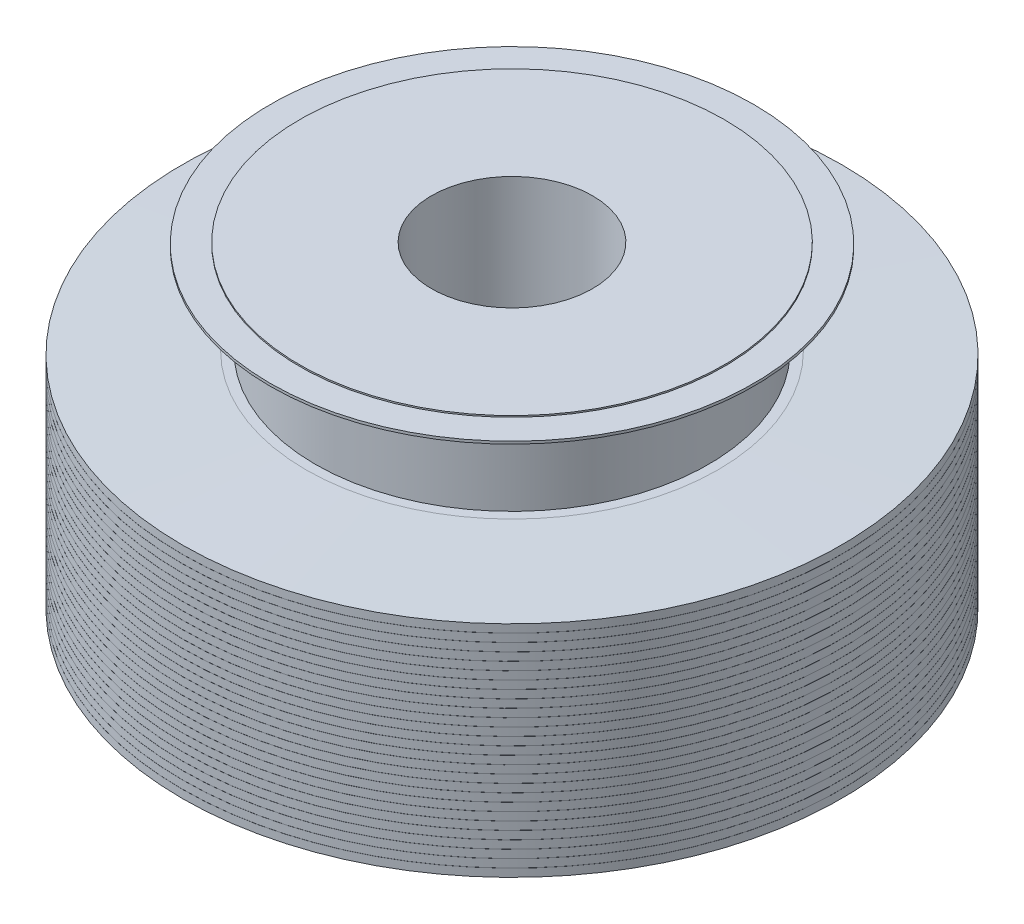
ISO-10303-21;
HEADER;
FILE_DESCRIPTION(('STEP AP214'),'2;1');
FILE_NAME('part.step','',(''),(''),'','','');
FILE_SCHEMA(('AUTOMOTIVE_DESIGN { 1 0 10303 214 1 1 1 1 }'));
ENDSEC;
DATA;
#1=APPLICATION_CONTEXT('core data for automotive mechanical design processes');
#2=APPLICATION_PROTOCOL_DEFINITION('international standard','automotive_design',2000,#1);
#3=PRODUCT_CONTEXT('',#1,'mechanical');
#4=PRODUCT('Part','Part','',(#3));
#5=PRODUCT_RELATED_PRODUCT_CATEGORY('part','',(#4));
#6=PRODUCT_DEFINITION_FORMATION('','',#4);
#7=PRODUCT_DEFINITION_CONTEXT('part definition',#1,'design');
#8=PRODUCT_DEFINITION('design','',#6,#7);
#9=PRODUCT_DEFINITION_SHAPE('','',#8);
#10=(LENGTH_UNIT() NAMED_UNIT(*) SI_UNIT(.MILLI.,.METRE.));
#11=(NAMED_UNIT(*) PLANE_ANGLE_UNIT() SI_UNIT($,.RADIAN.));
#12=(NAMED_UNIT(*) SI_UNIT($,.STERADIAN.) SOLID_ANGLE_UNIT());
#13=UNCERTAINTY_MEASURE_WITH_UNIT(LENGTH_MEASURE(1.E-05),#10,'distance_accuracy_value','');
#14=(GEOMETRIC_REPRESENTATION_CONTEXT(3) GLOBAL_UNCERTAINTY_ASSIGNED_CONTEXT((#13)) GLOBAL_UNIT_ASSIGNED_CONTEXT((#10,
#11,#12)) REPRESENTATION_CONTEXT('',''));
#15=CARTESIAN_POINT('',(0.,0.,0.));
#16=DIRECTION('',(0.,0.,1.));
#17=DIRECTION('',(1.,0.,0.));
#18=AXIS2_PLACEMENT_3D('',#15,#16,#17);
#19=CARTESIAN_POINT('',(23.35,0.,0.));
#20=DIRECTION('',(0.,1.,0.));
#21=DIRECTION('',(1.,0.,0.));
#22=AXIS2_PLACEMENT_3D('',#19,#20,#21);
#23=PLANE('',#22);
#24=CARTESIAN_POINT('',(0.,0.,0.));
#25=DIRECTION('',(0.,-1.,0.));
#26=DIRECTION('',(0.,0.,-1.));
#27=AXIS2_PLACEMENT_3D('',#24,#25,#26);
#28=CIRCLE('',#27,23.35);
#29=CARTESIAN_POINT('',(0.,0.,-23.35));
#30=VERTEX_POINT('',#29);
#31=EDGE_CURVE('E11',#30,#30,#28,.T.);
#32=ORIENTED_EDGE('',*,*,#31,.T.);
#33=EDGE_LOOP('',(#32));
#34=FACE_BOUND('',#33,.T.);
#35=CARTESIAN_POINT('',(0.,0.,0.));
#36=DIRECTION('',(0.,-1.,0.));
#37=DIRECTION('',(0.,0.,-1.));
#38=AXIS2_PLACEMENT_3D('',#35,#36,#37);
#39=CIRCLE('',#38,11.);
#40=CARTESIAN_POINT('',(0.,0.,-11.));
#41=VERTEX_POINT('',#40);
#42=EDGE_CURVE('E681',#41,#41,#39,.T.);
#43=ORIENTED_EDGE('',*,*,#42,.F.);
#44=EDGE_LOOP('',(#43));
#45=FACE_BOUND('',#44,.T.);
#46=ADVANCED_FACE('F16',(#34,#45),#23,.F.);
#47=CARTESIAN_POINT('',(0.,0.,0.));
#48=DIRECTION('',(0.,1.,0.));
#49=DIRECTION('',(0.,0.,-1.));
#50=AXIS2_PLACEMENT_3D('',#47,#48,#49);
#51=CYLINDRICAL_SURFACE('',#50,23.35);
#52=CARTESIAN_POINT('',(0.,0.7,0.));
#53=DIRECTION('',(0.,-1.,0.));
#54=DIRECTION('',(0.,0.,-1.));
#55=AXIS2_PLACEMENT_3D('',#52,#53,#54);
#56=CIRCLE('',#55,23.35);
#57=CARTESIAN_POINT('',(0.,0.7,-23.35));
#58=VERTEX_POINT('',#57);
#59=EDGE_CURVE('E27',#58,#58,#56,.T.);
#60=ORIENTED_EDGE('',*,*,#59,.T.);
#61=EDGE_LOOP('',(#60));
#62=FACE_BOUND('',#61,.T.);
#63=ORIENTED_EDGE('',*,*,#31,.F.);
#64=EDGE_LOOP('',(#63));
#65=FACE_BOUND('',#64,.T.);
#66=ADVANCED_FACE('F764',(#62,#65),#51,.T.);
#67=CARTESIAN_POINT('',(22.85,0.7,0.));
#68=DIRECTION('',(0.,-1.,0.));
#69=DIRECTION('',(0.,0.,-1.));
#70=AXIS2_PLACEMENT_3D('',#67,#68,#69);
#71=PLANE('',#70);
#72=ORIENTED_EDGE('',*,*,#59,.F.);
#73=EDGE_LOOP('',(#72));
#74=FACE_BOUND('',#73,.T.);
#75=CARTESIAN_POINT('',(0.,0.7,0.));
#76=DIRECTION('',(0.,-1.,0.));
#77=DIRECTION('',(0.,0.,-1.));
#78=AXIS2_PLACEMENT_3D('',#75,#76,#77);
#79=CIRCLE('',#78,22.85);
#80=CARTESIAN_POINT('',(0.,0.7,-22.85));
#81=VERTEX_POINT('',#80);
#82=EDGE_CURVE('E465',#81,#81,#79,.T.);
#83=ORIENTED_EDGE('',*,*,#82,.T.);
#84=EDGE_LOOP('',(#83));
#85=FACE_BOUND('',#84,.T.);
#86=ADVANCED_FACE('F771',(#74,#85),#71,.F.);
#87=CARTESIAN_POINT('',(0.,0.,0.));
#88=DIRECTION('',(0.,1.,0.));
#89=DIRECTION('',(0.,0.,-1.));
#90=AXIS2_PLACEMENT_3D('',#87,#88,#89);
#91=CYLINDRICAL_SURFACE('',#90,22.85);
#92=CARTESIAN_POINT('',(0.,6.57,0.));
#93=DIRECTION('',(0.,-1.,0.));
#94=DIRECTION('',(0.,0.,-1.));
#95=AXIS2_PLACEMENT_3D('',#92,#93,#94);
#96=CIRCLE('',#95,22.85);
#97=CARTESIAN_POINT('',(0.,6.57,-22.85));
#98=VERTEX_POINT('',#97);
#99=EDGE_CURVE('E461',#98,#98,#96,.T.);
#100=ORIENTED_EDGE('',*,*,#99,.T.);
#101=EDGE_LOOP('',(#100));
#102=FACE_BOUND('',#101,.T.);
#103=ORIENTED_EDGE('',*,*,#82,.F.);
#104=EDGE_LOOP('',(#103));
#105=FACE_BOUND('',#104,.T.);
#106=ADVANCED_FACE('F907',(#102,#105),#91,.T.);
#107=CARTESIAN_POINT('',(0.,7.35,0.));
#108=DIRECTION('',(0.,1.,0.));
#109=DIRECTION('',(0.,0.,1.));
#110=AXIS2_PLACEMENT_3D('',#107,#108,#109);
#111=CONICAL_SURFACE('',#110,23.63,0.7853981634);
#112=CARTESIAN_POINT('',(0.,7.35,0.));
#113=DIRECTION('',(0.,-1.,0.));
#114=DIRECTION('',(0.,0.,-1.));
#115=AXIS2_PLACEMENT_3D('',#112,#113,#114);
#116=CIRCLE('',#115,23.63);
#117=CARTESIAN_POINT('',(0.,7.35,-23.63));
#118=VERTEX_POINT('',#117);
#119=EDGE_CURVE('E466',#118,#118,#116,.T.);
#120=ORIENTED_EDGE('',*,*,#119,.T.);
#121=EDGE_LOOP('',(#120));
#122=FACE_BOUND('',#121,.T.);
#123=ORIENTED_EDGE('',*,*,#99,.F.);
#124=EDGE_LOOP('',(#123));
#125=FACE_BOUND('',#124,.T.);
#126=ADVANCED_FACE('F903',(#122,#125),#111,.T.);
#127=CARTESIAN_POINT('',(24.85,7.35,0.));
#128=DIRECTION('',(0.,1.,0.));
#129=DIRECTION('',(1.,0.,0.));
#130=AXIS2_PLACEMENT_3D('',#127,#128,#129);
#131=PLANE('',#130);
#132=CARTESIAN_POINT('',(0.,7.35,0.));
#133=DIRECTION('',(0.,-1.,0.));
#134=DIRECTION('',(0.,0.,-1.));
#135=AXIS2_PLACEMENT_3D('',#132,#133,#134);
#136=CIRCLE('',#135,24.85);
#137=CARTESIAN_POINT('',(0.,7.35,-24.85));
#138=VERTEX_POINT('',#137);
#139=EDGE_CURVE('E623',#138,#138,#136,.T.);
#140=ORIENTED_EDGE('',*,*,#139,.T.);
#141=EDGE_LOOP('',(#140));
#142=FACE_BOUND('',#141,.T.);
#143=ORIENTED_EDGE('',*,*,#119,.F.);
#144=EDGE_LOOP('',(#143));
#145=FACE_BOUND('',#144,.T.);
#146=ADVANCED_FACE('F906',(#142,#145),#131,.F.);
#147=CARTESIAN_POINT('',(0.,0.,0.));
#148=DIRECTION('',(0.,1.,0.));
#149=DIRECTION('',(0.,0.,-1.));
#150=AXIS2_PLACEMENT_3D('',#147,#148,#149);
#151=CYLINDRICAL_SURFACE('',#150,24.85);
#152=CARTESIAN_POINT('',(0.,7.55,0.));
#153=DIRECTION('',(0.,-1.,0.));
#154=DIRECTION('',(0.,0.,-1.));
#155=AXIS2_PLACEMENT_3D('',#152,#153,#154);
#156=CIRCLE('',#155,24.85);
#157=CARTESIAN_POINT('',(0.,7.55,-24.85));
#158=VERTEX_POINT('',#157);
#159=EDGE_CURVE('E627',#158,#158,#156,.T.);
#160=ORIENTED_EDGE('',*,*,#159,.T.);
#161=EDGE_LOOP('',(#160));
#162=FACE_BOUND('',#161,.T.);
#163=ORIENTED_EDGE('',*,*,#139,.F.);
#164=EDGE_LOOP('',(#163));
#165=FACE_BOUND('',#164,.T.);
#166=ADVANCED_FACE('F817',(#162,#165),#151,.T.);
#167=CARTESIAN_POINT('',(0.,38.05,0.));
#168=DIRECTION('',(0.,-1.,0.));
#169=DIRECTION('',(0.,0.,-1.));
#170=AXIS2_PLACEMENT_3D('',#167,#168,#169);
#171=PLANE('',#170);
#172=CARTESIAN_POINT('',(0.,38.05,0.));
#173=DIRECTION('',(0.,-1.,0.));
#174=DIRECTION('',(0.,0.,-1.));
#175=AXIS2_PLACEMENT_3D('',#172,#173,#174);
#176=CIRCLE('',#175,28.1363788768);
#177=CARTESIAN_POINT('',(0.,38.05,-28.1363788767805));
#178=VERTEX_POINT('',#177);
#179=EDGE_CURVE('E657',#178,#178,#176,.T.);
#180=ORIENTED_EDGE('',*,*,#179,.F.);
#181=EDGE_LOOP('',(#180));
#182=FACE_BOUND('',#181,.T.);
#183=CARTESIAN_POINT('',(0.,38.05,0.));
#184=DIRECTION('',(0.,-1.,0.));
#185=DIRECTION('',(0.,0.,-1.));
#186=AXIS2_PLACEMENT_3D('',#183,#184,#185);
#187=CIRCLE('',#186,26.85);
#188=CARTESIAN_POINT('',(0.,38.05,-26.85));
#189=VERTEX_POINT('',#188);
#190=EDGE_CURVE('E661',#189,#189,#187,.T.);
#191=ORIENTED_EDGE('',*,*,#190,.T.);
#192=EDGE_LOOP('',(#191));
#193=FACE_BOUND('',#192,.T.);
#194=ADVANCED_FACE('F813',(#182,#193),#171,.F.);
#195=CARTESIAN_POINT('',(0.,38.05,0.));
#196=DIRECTION('',(0.,-1.,0.));
#197=DIRECTION('',(0.,0.,-1.));
#198=AXIS2_PLACEMENT_3D('',#195,#196,#197);
#199=CONICAL_SURFACE('',#198,28.1363788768,1.5434424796);
#200=CARTESIAN_POINT('',(0.,37.5886,0.));
#201=DIRECTION('',(0.,-1.,0.));
#202=DIRECTION('',(0.,0.,-1.));
#203=AXIS2_PLACEMENT_3D('',#200,#201,#202);
#204=CIRCLE('',#203,45.);
#205=CARTESIAN_POINT('',(0.,37.5886,-45.));
#206=VERTEX_POINT('',#205);
#207=EDGE_CURVE('E479',#206,#206,#204,.T.);
#208=ORIENTED_EDGE('',*,*,#207,.F.);
#209=EDGE_LOOP('',(#208));
#210=FACE_BOUND('',#209,.T.);
#211=ORIENTED_EDGE('',*,*,#179,.T.);
#212=EDGE_LOOP('',(#211));
#213=FACE_BOUND('',#212,.T.);
#214=ADVANCED_FACE('F816',(#210,#213),#199,.T.);
#215=CARTESIAN_POINT('',(0.,7.55,0.));
#216=DIRECTION('',(0.,1.,0.));
#217=DIRECTION('',(0.,0.,-1.));
#218=AXIS2_PLACEMENT_3D('',#215,#216,#217);
#219=CYLINDRICAL_SURFACE('',#218,45.);
#220=ORIENTED_EDGE('',*,*,#207,.T.);
#221=EDGE_LOOP('',(#220));
#222=FACE_BOUND('',#221,.T.);
#223=CARTESIAN_POINT('',(0.,36.491352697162,0.));
#224=DIRECTION('',(0.,-1.,0.));
#225=DIRECTION('',(0.,0.,-1.));
#226=AXIS2_PLACEMENT_3D('',#223,#224,#225);
#227=CIRCLE('',#226,45.);
#228=CARTESIAN_POINT('',(0.,36.491352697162,-45.));
#229=VERTEX_POINT('',#228);
#230=EDGE_CURVE('E446',#229,#229,#227,.T.);
#231=ORIENTED_EDGE('',*,*,#230,.F.);
#232=EDGE_LOOP('',(#231));
#233=FACE_BOUND('',#232,.T.);
#234=ADVANCED_FACE('F1168',(#222,#233),#219,.T.);
#235=CARTESIAN_POINT('',(0.,36.491352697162,0.));
#236=DIRECTION('',(0.,1.,0.));
#237=DIRECTION('',(0.,0.,1.));
#238=AXIS2_PLACEMENT_3D('',#235,#236,#237);
#239=CONICAL_SURFACE('',#238,45.,1.5681783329);
#240=ORIENTED_EDGE('',*,*,#230,.T.);
#241=EDGE_LOOP('',(#240));
#242=FACE_BOUND('',#241,.T.);
#243=CARTESIAN_POINT('',(0.,36.484426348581,0.));
#244=DIRECTION('',(0.,-1.,0.));
#245=DIRECTION('',(0.,0.,-1.));
#246=AXIS2_PLACEMENT_3D('',#243,#244,#245);
#247=CIRCLE('',#246,42.3543357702);
#248=CARTESIAN_POINT('',(0.,36.484426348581,-42.3543357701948));
#249=VERTEX_POINT('',#248);
#250=EDGE_CURVE('E443',#249,#249,#247,.T.);
#251=ORIENTED_EDGE('',*,*,#250,.F.);
#252=EDGE_LOOP('',(#251));
#253=FACE_BOUND('',#252,.T.);
#254=ADVANCED_FACE('F1165',(#242,#253),#239,.T.);
#255=CARTESIAN_POINT('',(0.,36.484426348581,0.));
#256=DIRECTION('',(0.,-1.,0.));
#257=DIRECTION('',(0.,0.,-1.));
#258=AXIS2_PLACEMENT_3D('',#255,#256,#257);
#259=CONICAL_SURFACE('',#258,42.3543357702,1.5681783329);
#260=CARTESIAN_POINT('',(0.,36.4775,0.));
#261=DIRECTION('',(0.,-1.,0.));
#262=DIRECTION('',(0.,0.,-1.));
#263=AXIS2_PLACEMENT_3D('',#260,#261,#262);
#264=CIRCLE('',#263,45.);
#265=CARTESIAN_POINT('',(0.,36.4775,-45.));
#266=VERTEX_POINT('',#265);
#267=EDGE_CURVE('E447',#266,#266,#264,.T.);
#268=ORIENTED_EDGE('',*,*,#267,.F.);
#269=EDGE_LOOP('',(#268));
#270=FACE_BOUND('',#269,.T.);
#271=ORIENTED_EDGE('',*,*,#250,.T.);
#272=EDGE_LOOP('',(#271));
#273=FACE_BOUND('',#272,.T.);
#274=ADVANCED_FACE('F1091',(#270,#273),#259,.T.);
#275=CARTESIAN_POINT('',(0.,7.55,0.));
#276=DIRECTION('',(0.,1.,0.));
#277=DIRECTION('',(0.,0.,-1.));
#278=AXIS2_PLACEMENT_3D('',#275,#276,#277);
#279=CYLINDRICAL_SURFACE('',#278,45.);
#280=ORIENTED_EDGE('',*,*,#267,.T.);
#281=EDGE_LOOP('',(#280));
#282=FACE_BOUND('',#281,.T.);
#283=CARTESIAN_POINT('',(0.,35.380252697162,0.));
#284=DIRECTION('',(0.,-1.,0.));
#285=DIRECTION('',(0.,0.,-1.));
#286=AXIS2_PLACEMENT_3D('',#283,#284,#285);
#287=CIRCLE('',#286,45.);
#288=CARTESIAN_POINT('',(0.,35.380252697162,-45.));
#289=VERTEX_POINT('',#288);
#290=EDGE_CURVE('E553',#289,#289,#287,.T.);
#291=ORIENTED_EDGE('',*,*,#290,.F.);
#292=EDGE_LOOP('',(#291));
#293=FACE_BOUND('',#292,.T.);
#294=ADVANCED_FACE('F1088',(#282,#293),#279,.T.);
#295=CARTESIAN_POINT('',(0.,35.380252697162,0.));
#296=DIRECTION('',(0.,1.,0.));
#297=DIRECTION('',(0.,0.,1.));
#298=AXIS2_PLACEMENT_3D('',#295,#296,#297);
#299=CONICAL_SURFACE('',#298,45.,1.5681783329);
#300=ORIENTED_EDGE('',*,*,#290,.T.);
#301=EDGE_LOOP('',(#300));
#302=FACE_BOUND('',#301,.T.);
#303=CARTESIAN_POINT('',(0.,35.373326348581,0.));
#304=DIRECTION('',(0.,-1.,0.));
#305=DIRECTION('',(0.,0.,-1.));
#306=AXIS2_PLACEMENT_3D('',#303,#304,#305);
#307=CIRCLE('',#306,42.3543357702);
#308=CARTESIAN_POINT('',(0.,35.373326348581,-42.3543357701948));
#309=VERTEX_POINT('',#308);
#310=EDGE_CURVE('E423',#309,#309,#307,.T.);
#311=ORIENTED_EDGE('',*,*,#310,.F.);
#312=EDGE_LOOP('',(#311));
#313=FACE_BOUND('',#312,.T.);
#314=ADVANCED_FACE('F1086',(#302,#313),#299,.T.);
#315=CARTESIAN_POINT('',(0.,35.373326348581,0.));
#316=DIRECTION('',(0.,-1.,0.));
#317=DIRECTION('',(0.,0.,-1.));
#318=AXIS2_PLACEMENT_3D('',#315,#316,#317);
#319=CONICAL_SURFACE('',#318,42.3543357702,1.5681783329);
#320=CARTESIAN_POINT('',(0.,35.3664,0.));
#321=DIRECTION('',(0.,-1.,0.));
#322=DIRECTION('',(0.,0.,-1.));
#323=AXIS2_PLACEMENT_3D('',#320,#321,#322);
#324=CIRCLE('',#323,45.);
#325=CARTESIAN_POINT('',(0.,35.3664,-45.));
#326=VERTEX_POINT('',#325);
#327=EDGE_CURVE('E415',#326,#326,#324,.T.);
#328=ORIENTED_EDGE('',*,*,#327,.F.);
#329=EDGE_LOOP('',(#328));
#330=FACE_BOUND('',#329,.T.);
#331=ORIENTED_EDGE('',*,*,#310,.T.);
#332=EDGE_LOOP('',(#331));
#333=FACE_BOUND('',#332,.T.);
#334=ADVANCED_FACE('F1083',(#330,#333),#319,.T.);
#335=CARTESIAN_POINT('',(0.,7.55,0.));
#336=DIRECTION('',(0.,1.,0.));
#337=DIRECTION('',(0.,0.,-1.));
#338=AXIS2_PLACEMENT_3D('',#335,#336,#337);
#339=CYLINDRICAL_SURFACE('',#338,45.);
#340=ORIENTED_EDGE('',*,*,#327,.T.);
#341=EDGE_LOOP('',(#340));
#342=FACE_BOUND('',#341,.T.);
#343=CARTESIAN_POINT('',(0.,34.269152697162,0.));
#344=DIRECTION('',(0.,-1.,0.));
#345=DIRECTION('',(0.,0.,-1.));
#346=AXIS2_PLACEMENT_3D('',#343,#344,#345);
#347=CIRCLE('',#346,45.);
#348=CARTESIAN_POINT('',(0.,34.269152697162,-45.));
#349=VERTEX_POINT('',#348);
#350=EDGE_CURVE('E411',#349,#349,#347,.T.);
#351=ORIENTED_EDGE('',*,*,#350,.F.);
#352=EDGE_LOOP('',(#351));
#353=FACE_BOUND('',#352,.T.);
#354=ADVANCED_FACE('F412',(#342,#353),#339,.T.);
#355=CARTESIAN_POINT('',(0.,34.269152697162,0.));
#356=DIRECTION('',(0.,1.,0.));
#357=DIRECTION('',(0.,0.,1.));
#358=AXIS2_PLACEMENT_3D('',#355,#356,#357);
#359=CONICAL_SURFACE('',#358,45.,1.5681783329);
#360=ORIENTED_EDGE('',*,*,#350,.T.);
#361=EDGE_LOOP('',(#360));
#362=FACE_BOUND('',#361,.T.);
#363=CARTESIAN_POINT('',(0.,34.262226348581,0.));
#364=DIRECTION('',(0.,-1.,0.));
#365=DIRECTION('',(0.,0.,-1.));
#366=AXIS2_PLACEMENT_3D('',#363,#364,#365);
#367=CIRCLE('',#366,42.3543357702);
#368=CARTESIAN_POINT('',(0.,34.262226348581,-42.3543357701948));
#369=VERTEX_POINT('',#368);
#370=EDGE_CURVE('E416',#369,#369,#367,.T.);
#371=ORIENTED_EDGE('',*,*,#370,.F.);
#372=EDGE_LOOP('',(#371));
#373=FACE_BOUND('',#372,.T.);
#374=ADVANCED_FACE('F1185',(#362,#373),#359,.T.);
#375=CARTESIAN_POINT('',(0.,34.262226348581,0.));
#376=DIRECTION('',(0.,-1.,0.));
#377=DIRECTION('',(0.,0.,-1.));
#378=AXIS2_PLACEMENT_3D('',#375,#376,#377);
#379=CONICAL_SURFACE('',#378,42.3543357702,1.5681783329);
#380=CARTESIAN_POINT('',(0.,34.2553,0.));
#381=DIRECTION('',(0.,-1.,0.));
#382=DIRECTION('',(0.,0.,-1.));
#383=AXIS2_PLACEMENT_3D('',#380,#381,#382);
#384=CIRCLE('',#383,45.);
#385=CARTESIAN_POINT('',(0.,34.2553,-45.));
#386=VERTEX_POINT('',#385);
#387=EDGE_CURVE('E427',#386,#386,#384,.T.);
#388=ORIENTED_EDGE('',*,*,#387,.F.);
#389=EDGE_LOOP('',(#388));
#390=FACE_BOUND('',#389,.T.);
#391=ORIENTED_EDGE('',*,*,#370,.T.);
#392=EDGE_LOOP('',(#391));
#393=FACE_BOUND('',#392,.T.);
#394=ADVANCED_FACE('F1071',(#390,#393),#379,.T.);
#395=CARTESIAN_POINT('',(0.,7.55,0.));
#396=DIRECTION('',(0.,1.,0.));
#397=DIRECTION('',(0.,0.,-1.));
#398=AXIS2_PLACEMENT_3D('',#395,#396,#397);
#399=CYLINDRICAL_SURFACE('',#398,45.);
#400=ORIENTED_EDGE('',*,*,#387,.T.);
#401=EDGE_LOOP('',(#400));
#402=FACE_BOUND('',#401,.T.);
#403=CARTESIAN_POINT('',(0.,33.158052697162,0.));
#404=DIRECTION('',(0.,-1.,0.));
#405=DIRECTION('',(0.,0.,-1.));
#406=AXIS2_PLACEMENT_3D('',#403,#404,#405);
#407=CIRCLE('',#406,45.);
#408=CARTESIAN_POINT('',(0.,33.158052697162,-45.));
#409=VERTEX_POINT('',#408);
#410=EDGE_CURVE('E588',#409,#409,#407,.T.);
#411=ORIENTED_EDGE('',*,*,#410,.F.);
#412=EDGE_LOOP('',(#411));
#413=FACE_BOUND('',#412,.T.);
#414=ADVANCED_FACE('F811',(#402,#413),#399,.T.);
#415=CARTESIAN_POINT('',(0.,33.158052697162,0.));
#416=DIRECTION('',(0.,1.,0.));
#417=DIRECTION('',(0.,0.,1.));
#418=AXIS2_PLACEMENT_3D('',#415,#416,#417);
#419=CONICAL_SURFACE('',#418,45.,1.5681783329);
#420=ORIENTED_EDGE('',*,*,#410,.T.);
#421=EDGE_LOOP('',(#420));
#422=FACE_BOUND('',#421,.T.);
#423=CARTESIAN_POINT('',(0.,33.151126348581,0.));
#424=DIRECTION('',(0.,-1.,0.));
#425=DIRECTION('',(0.,0.,-1.));
#426=AXIS2_PLACEMENT_3D('',#423,#424,#425);
#427=CIRCLE('',#426,42.3543357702);
#428=CARTESIAN_POINT('',(0.,33.151126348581,-42.3543357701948));
#429=VERTEX_POINT('',#428);
#430=EDGE_CURVE('E584',#429,#429,#427,.T.);
#431=ORIENTED_EDGE('',*,*,#430,.F.);
#432=EDGE_LOOP('',(#431));
#433=FACE_BOUND('',#432,.T.);
#434=ADVANCED_FACE('F807',(#422,#433),#419,.T.);
#435=CARTESIAN_POINT('',(0.,33.151126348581,0.));
#436=DIRECTION('',(0.,-1.,0.));
#437=DIRECTION('',(0.,0.,-1.));
#438=AXIS2_PLACEMENT_3D('',#435,#436,#437);
#439=CONICAL_SURFACE('',#438,42.3543357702,1.5681783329);
#440=CARTESIAN_POINT('',(0.,33.1442,0.));
#441=DIRECTION('',(0.,-1.,0.));
#442=DIRECTION('',(0.,0.,-1.));
#443=AXIS2_PLACEMENT_3D('',#440,#441,#442);
#444=CIRCLE('',#443,45.);
#445=CARTESIAN_POINT('',(0.,33.1442,-45.));
#446=VERTEX_POINT('',#445);
#447=EDGE_CURVE('E589',#446,#446,#444,.T.);
#448=ORIENTED_EDGE('',*,*,#447,.F.);
#449=EDGE_LOOP('',(#448));
#450=FACE_BOUND('',#449,.T.);
#451=ORIENTED_EDGE('',*,*,#430,.T.);
#452=EDGE_LOOP('',(#451));
#453=FACE_BOUND('',#452,.T.);
#454=ADVANCED_FACE('F810',(#450,#453),#439,.T.);
#455=CARTESIAN_POINT('',(0.,7.55,0.));
#456=DIRECTION('',(0.,1.,0.));
#457=DIRECTION('',(0.,0.,-1.));
#458=AXIS2_PLACEMENT_3D('',#455,#456,#457);
#459=CYLINDRICAL_SURFACE('',#458,45.);
#460=ORIENTED_EDGE('',*,*,#447,.T.);
#461=EDGE_LOOP('',(#460));
#462=FACE_BOUND('',#461,.T.);
#463=CARTESIAN_POINT('',(0.,32.046952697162,0.));
#464=DIRECTION('',(0.,-1.,0.));
#465=DIRECTION('',(0.,0.,-1.));
#466=AXIS2_PLACEMENT_3D('',#463,#464,#465);
#467=CIRCLE('',#466,45.);
#468=CARTESIAN_POINT('',(0.,32.046952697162,-45.));
#469=VERTEX_POINT('',#468);
#470=EDGE_CURVE('E560',#469,#469,#467,.T.);
#471=ORIENTED_EDGE('',*,*,#470,.F.);
#472=EDGE_LOOP('',(#471));
#473=FACE_BOUND('',#472,.T.);
#474=ADVANCED_FACE('F863',(#462,#473),#459,.T.);
#475=CARTESIAN_POINT('',(0.,32.046952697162,0.));
#476=DIRECTION('',(0.,1.,0.));
#477=DIRECTION('',(0.,0.,1.));
#478=AXIS2_PLACEMENT_3D('',#475,#476,#477);
#479=CONICAL_SURFACE('',#478,45.,1.5681783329);
#480=ORIENTED_EDGE('',*,*,#470,.T.);
#481=EDGE_LOOP('',(#480));
#482=FACE_BOUND('',#481,.T.);
#483=CARTESIAN_POINT('',(0.,32.040026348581,0.));
#484=DIRECTION('',(0.,-1.,0.));
#485=DIRECTION('',(0.,0.,-1.));
#486=AXIS2_PLACEMENT_3D('',#483,#484,#485);
#487=CIRCLE('',#486,42.3543357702);
#488=CARTESIAN_POINT('',(0.,32.040026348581,-42.3543357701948));
#489=VERTEX_POINT('',#488);
#490=EDGE_CURVE('E519',#489,#489,#487,.T.);
#491=ORIENTED_EDGE('',*,*,#490,.F.);
#492=EDGE_LOOP('',(#491));
#493=FACE_BOUND('',#492,.T.);
#494=ADVANCED_FACE('F859',(#482,#493),#479,.T.);
#495=CARTESIAN_POINT('',(0.,32.040026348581,0.));
#496=DIRECTION('',(0.,-1.,0.));
#497=DIRECTION('',(0.,0.,-1.));
#498=AXIS2_PLACEMENT_3D('',#495,#496,#497);
#499=CONICAL_SURFACE('',#498,42.3543357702,1.5681783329);
#500=CARTESIAN_POINT('',(0.,32.0331,0.));
#501=DIRECTION('',(0.,-1.,0.));
#502=DIRECTION('',(0.,0.,-1.));
#503=AXIS2_PLACEMENT_3D('',#500,#501,#502);
#504=CIRCLE('',#503,45.);
#505=CARTESIAN_POINT('',(0.,32.0331,-45.));
#506=VERTEX_POINT('',#505);
#507=EDGE_CURVE('E484',#506,#506,#504,.T.);
#508=ORIENTED_EDGE('',*,*,#507,.F.);
#509=EDGE_LOOP('',(#508));
#510=FACE_BOUND('',#509,.T.);
#511=ORIENTED_EDGE('',*,*,#490,.T.);
#512=EDGE_LOOP('',(#511));
#513=FACE_BOUND('',#512,.T.);
#514=ADVANCED_FACE('F862',(#510,#513),#499,.T.);
#515=CARTESIAN_POINT('',(0.,7.55,0.));
#516=DIRECTION('',(0.,1.,0.));
#517=DIRECTION('',(0.,0.,-1.));
#518=AXIS2_PLACEMENT_3D('',#515,#516,#517);
#519=CYLINDRICAL_SURFACE('',#518,45.);
#520=ORIENTED_EDGE('',*,*,#507,.T.);
#521=EDGE_LOOP('',(#520));
#522=FACE_BOUND('',#521,.T.);
#523=CARTESIAN_POINT('',(0.,30.935852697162,0.));
#524=DIRECTION('',(0.,-1.,0.));
#525=DIRECTION('',(0.,0.,-1.));
#526=AXIS2_PLACEMENT_3D('',#523,#524,#525);
#527=CIRCLE('',#526,45.);
#528=CARTESIAN_POINT('',(0.,30.935852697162,-45.));
#529=VERTEX_POINT('',#528);
#530=EDGE_CURVE('E480',#529,#529,#527,.T.);
#531=ORIENTED_EDGE('',*,*,#530,.F.);
#532=EDGE_LOOP('',(#531));
#533=FACE_BOUND('',#532,.T.);
#534=ADVANCED_FACE('F898',(#522,#533),#519,.T.);
#535=CARTESIAN_POINT('',(0.,30.935852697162,0.));
#536=DIRECTION('',(0.,1.,0.));
#537=DIRECTION('',(0.,0.,1.));
#538=AXIS2_PLACEMENT_3D('',#535,#536,#537);
#539=CONICAL_SURFACE('',#538,45.,1.5681783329);
#540=ORIENTED_EDGE('',*,*,#530,.T.);
#541=EDGE_LOOP('',(#540));
#542=FACE_BOUND('',#541,.T.);
#543=CARTESIAN_POINT('',(0.,30.928926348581,0.));
#544=DIRECTION('',(0.,-1.,0.));
#545=DIRECTION('',(0.,0.,-1.));
#546=AXIS2_PLACEMENT_3D('',#543,#544,#545);
#547=CIRCLE('',#546,42.3543357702);
#548=CARTESIAN_POINT('',(0.,30.928926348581,-42.3543357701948));
#549=VERTEX_POINT('',#548);
#550=EDGE_CURVE('E485',#549,#549,#547,.T.);
#551=ORIENTED_EDGE('',*,*,#550,.F.);
#552=EDGE_LOOP('',(#551));
#553=FACE_BOUND('',#552,.T.);
#554=ADVANCED_FACE('F895',(#542,#553),#539,.T.);
#555=CARTESIAN_POINT('',(0.,30.928926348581,0.));
#556=DIRECTION('',(0.,-1.,0.));
#557=DIRECTION('',(0.,0.,-1.));
#558=AXIS2_PLACEMENT_3D('',#555,#556,#557);
#559=CONICAL_SURFACE('',#558,42.3543357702,1.5681783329);
#560=CARTESIAN_POINT('',(0.,30.922,0.));
#561=DIRECTION('',(0.,-1.,0.));
#562=DIRECTION('',(0.,0.,-1.));
#563=AXIS2_PLACEMENT_3D('',#560,#561,#562);
#564=CIRCLE('',#563,45.);
#565=CARTESIAN_POINT('',(0.,30.922,-45.));
#566=VERTEX_POINT('',#565);
#567=EDGE_CURVE('E322',#566,#566,#564,.T.);
#568=ORIENTED_EDGE('',*,*,#567,.F.);
#569=EDGE_LOOP('',(#568));
#570=FACE_BOUND('',#569,.T.);
#571=ORIENTED_EDGE('',*,*,#550,.T.);
#572=EDGE_LOOP('',(#571));
#573=FACE_BOUND('',#572,.T.);
#574=ADVANCED_FACE('F799',(#570,#573),#559,.T.);
#575=CARTESIAN_POINT('',(0.,7.55,0.));
#576=DIRECTION('',(0.,1.,0.));
#577=DIRECTION('',(0.,0.,-1.));
#578=AXIS2_PLACEMENT_3D('',#575,#576,#577);
#579=CYLINDRICAL_SURFACE('',#578,45.);
#580=ORIENTED_EDGE('',*,*,#567,.T.);
#581=EDGE_LOOP('',(#580));
#582=FACE_BOUND('',#581,.T.);
#583=CARTESIAN_POINT('',(0.,29.824752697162,0.));
#584=DIRECTION('',(0.,-1.,0.));
#585=DIRECTION('',(0.,0.,-1.));
#586=AXIS2_PLACEMENT_3D('',#583,#584,#585);
#587=CIRCLE('',#586,45.);
#588=CARTESIAN_POINT('',(0.,29.824752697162,-45.));
#589=VERTEX_POINT('',#588);
#590=EDGE_CURVE('E332',#589,#589,#587,.T.);
#591=ORIENTED_EDGE('',*,*,#590,.F.);
#592=EDGE_LOOP('',(#591));
#593=FACE_BOUND('',#592,.T.);
#594=ADVANCED_FACE('F795',(#582,#593),#579,.T.);
#595=CARTESIAN_POINT('',(0.,29.824752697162,0.));
#596=DIRECTION('',(0.,1.,0.));
#597=DIRECTION('',(0.,0.,1.));
#598=AXIS2_PLACEMENT_3D('',#595,#596,#597);
#599=CONICAL_SURFACE('',#598,45.,1.5681783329);
#600=ORIENTED_EDGE('',*,*,#590,.T.);
#601=EDGE_LOOP('',(#600));
#602=FACE_BOUND('',#601,.T.);
#603=CARTESIAN_POINT('',(0.,29.817826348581,0.));
#604=DIRECTION('',(0.,-1.,0.));
#605=DIRECTION('',(0.,0.,-1.));
#606=AXIS2_PLACEMENT_3D('',#603,#604,#605);
#607=CIRCLE('',#606,42.3543357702);
#608=CARTESIAN_POINT('',(0.,29.817826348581,-42.3543357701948));
#609=VERTEX_POINT('',#608);
#610=EDGE_CURVE('E469',#609,#609,#607,.T.);
#611=ORIENTED_EDGE('',*,*,#610,.F.);
#612=EDGE_LOOP('',(#611));
#613=FACE_BOUND('',#612,.T.);
#614=ADVANCED_FACE('F798',(#602,#613),#599,.T.);
#615=CARTESIAN_POINT('',(0.,29.817826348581,0.));
#616=DIRECTION('',(0.,-1.,0.));
#617=DIRECTION('',(0.,0.,-1.));
#618=AXIS2_PLACEMENT_3D('',#615,#616,#617);
#619=CONICAL_SURFACE('',#618,42.3543357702,1.5681783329);
#620=CARTESIAN_POINT('',(0.,29.8109,0.));
#621=DIRECTION('',(0.,-1.,0.));
#622=DIRECTION('',(0.,0.,-1.));
#623=AXIS2_PLACEMENT_3D('',#620,#621,#622);
#624=CIRCLE('',#623,45.);
#625=CARTESIAN_POINT('',(0.,29.8109,-45.));
#626=VERTEX_POINT('',#625);
#627=EDGE_CURVE('E631',#626,#626,#624,.T.);
#628=ORIENTED_EDGE('',*,*,#627,.F.);
#629=EDGE_LOOP('',(#628));
#630=FACE_BOUND('',#629,.T.);
#631=ORIENTED_EDGE('',*,*,#610,.T.);
#632=EDGE_LOOP('',(#631));
#633=FACE_BOUND('',#632,.T.);
#634=ADVANCED_FACE('F857',(#630,#633),#619,.T.);
#635=CARTESIAN_POINT('',(0.,7.55,0.));
#636=DIRECTION('',(0.,1.,0.));
#637=DIRECTION('',(0.,0.,-1.));
#638=AXIS2_PLACEMENT_3D('',#635,#636,#637);
#639=CYLINDRICAL_SURFACE('',#638,45.);
#640=ORIENTED_EDGE('',*,*,#627,.T.);
#641=EDGE_LOOP('',(#640));
#642=FACE_BOUND('',#641,.T.);
#643=CARTESIAN_POINT('',(0.,28.713652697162,0.));
#644=DIRECTION('',(0.,-1.,0.));
#645=DIRECTION('',(0.,0.,-1.));
#646=AXIS2_PLACEMENT_3D('',#643,#644,#645);
#647=CIRCLE('',#646,45.);
#648=CARTESIAN_POINT('',(0.,28.713652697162,-45.));
#649=VERTEX_POINT('',#648);
#650=EDGE_CURVE('E704',#649,#649,#647,.T.);
#651=ORIENTED_EDGE('',*,*,#650,.F.);
#652=EDGE_LOOP('',(#651));
#653=FACE_BOUND('',#652,.T.);
#654=ADVANCED_FACE('F805',(#642,#653),#639,.T.);
#655=CARTESIAN_POINT('',(0.,28.713652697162,0.));
#656=DIRECTION('',(0.,1.,0.));
#657=DIRECTION('',(0.,0.,1.));
#658=AXIS2_PLACEMENT_3D('',#655,#656,#657);
#659=CONICAL_SURFACE('',#658,45.,1.5681783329);
#660=ORIENTED_EDGE('',*,*,#650,.T.);
#661=EDGE_LOOP('',(#660));
#662=FACE_BOUND('',#661,.T.);
#663=CARTESIAN_POINT('',(0.,28.706726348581,0.));
#664=DIRECTION('',(0.,-1.,0.));
#665=DIRECTION('',(0.,0.,-1.));
#666=AXIS2_PLACEMENT_3D('',#663,#664,#665);
#667=CIRCLE('',#666,42.3543357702);
#668=CARTESIAN_POINT('',(0.,28.706726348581,-42.3543357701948));
#669=VERTEX_POINT('',#668);
#670=EDGE_CURVE('E500',#669,#669,#667,.T.);
#671=ORIENTED_EDGE('',*,*,#670,.F.);
#672=EDGE_LOOP('',(#671));
#673=FACE_BOUND('',#672,.T.);
#674=ADVANCED_FACE('F801',(#662,#673),#659,.T.);
#675=CARTESIAN_POINT('',(0.,28.706726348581,0.));
#676=DIRECTION('',(0.,-1.,0.));
#677=DIRECTION('',(0.,0.,-1.));
#678=AXIS2_PLACEMENT_3D('',#675,#676,#677);
#679=CONICAL_SURFACE('',#678,42.3543357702,1.5681783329);
#680=CARTESIAN_POINT('',(0.,28.6998,0.));
#681=DIRECTION('',(0.,-1.,0.));
#682=DIRECTION('',(0.,0.,-1.));
#683=AXIS2_PLACEMENT_3D('',#680,#681,#682);
#684=CIRCLE('',#683,45.);
#685=CARTESIAN_POINT('',(0.,28.6998,-45.));
#686=VERTEX_POINT('',#685);
#687=EDGE_CURVE('E496',#686,#686,#684,.T.);
#688=ORIENTED_EDGE('',*,*,#687,.F.);
#689=EDGE_LOOP('',(#688));
#690=FACE_BOUND('',#689,.T.);
#691=ORIENTED_EDGE('',*,*,#670,.T.);
#692=EDGE_LOOP('',(#691));
#693=FACE_BOUND('',#692,.T.);
#694=ADVANCED_FACE('F804',(#690,#693),#679,.T.);
#695=CARTESIAN_POINT('',(0.,7.55,0.));
#696=DIRECTION('',(0.,1.,0.));
#697=DIRECTION('',(0.,0.,-1.));
#698=AXIS2_PLACEMENT_3D('',#695,#696,#697);
#699=CYLINDRICAL_SURFACE('',#698,45.);
#700=ORIENTED_EDGE('',*,*,#687,.T.);
#701=EDGE_LOOP('',(#700));
#702=FACE_BOUND('',#701,.T.);
#703=CARTESIAN_POINT('',(0.,27.602552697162,0.));
#704=DIRECTION('',(0.,-1.,0.));
#705=DIRECTION('',(0.,0.,-1.));
#706=AXIS2_PLACEMENT_3D('',#703,#704,#705);
#707=CIRCLE('',#706,45.);
#708=CARTESIAN_POINT('',(0.,27.602552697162,-45.));
#709=VERTEX_POINT('',#708);
#710=EDGE_CURVE('E501',#709,#709,#707,.T.);
#711=ORIENTED_EDGE('',*,*,#710,.F.);
#712=EDGE_LOOP('',(#711));
#713=FACE_BOUND('',#712,.T.);
#714=ADVANCED_FACE('F1073',(#702,#713),#699,.T.);
#715=CARTESIAN_POINT('',(0.,27.602552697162,0.));
#716=DIRECTION('',(0.,1.,0.));
#717=DIRECTION('',(0.,0.,1.));
#718=AXIS2_PLACEMENT_3D('',#715,#716,#717);
#719=CONICAL_SURFACE('',#718,45.,1.5681783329);
#720=ORIENTED_EDGE('',*,*,#710,.T.);
#721=EDGE_LOOP('',(#720));
#722=FACE_BOUND('',#721,.T.);
#723=CARTESIAN_POINT('',(0.,27.595626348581,0.));
#724=DIRECTION('',(0.,-1.,0.));
#725=DIRECTION('',(0.,0.,-1.));
#726=AXIS2_PLACEMENT_3D('',#723,#724,#725);
#727=CIRCLE('',#726,42.3543357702);
#728=CARTESIAN_POINT('',(0.,27.595626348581,-42.3543357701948));
#729=VERTEX_POINT('',#728);
#730=EDGE_CURVE('E435',#729,#729,#727,.T.);
#731=ORIENTED_EDGE('',*,*,#730,.F.);
#732=EDGE_LOOP('',(#731));
#733=FACE_BOUND('',#732,.T.);
#734=ADVANCED_FACE('F1026',(#722,#733),#719,.T.);
#735=CARTESIAN_POINT('',(0.,27.595626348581,0.));
#736=DIRECTION('',(0.,-1.,0.));
#737=DIRECTION('',(0.,0.,-1.));
#738=AXIS2_PLACEMENT_3D('',#735,#736,#737);
#739=CONICAL_SURFACE('',#738,42.3543357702,1.5681783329);
#740=CARTESIAN_POINT('',(0.,27.5887,0.));
#741=DIRECTION('',(0.,-1.,0.));
#742=DIRECTION('',(0.,0.,-1.));
#743=AXIS2_PLACEMENT_3D('',#740,#741,#742);
#744=CIRCLE('',#743,45.);
#745=CARTESIAN_POINT('',(0.,27.5887,-45.));
#746=VERTEX_POINT('',#745);
#747=EDGE_CURVE('E432',#746,#746,#744,.T.);
#748=ORIENTED_EDGE('',*,*,#747,.F.);
#749=EDGE_LOOP('',(#748));
#750=FACE_BOUND('',#749,.T.);
#751=ORIENTED_EDGE('',*,*,#730,.T.);
#752=EDGE_LOOP('',(#751));
#753=FACE_BOUND('',#752,.T.);
#754=ADVANCED_FACE('F823',(#750,#753),#739,.T.);
#755=CARTESIAN_POINT('',(0.,7.55,0.));
#756=DIRECTION('',(0.,1.,0.));
#757=DIRECTION('',(0.,0.,-1.));
#758=AXIS2_PLACEMENT_3D('',#755,#756,#757);
#759=CYLINDRICAL_SURFACE('',#758,45.);
#760=ORIENTED_EDGE('',*,*,#747,.T.);
#761=EDGE_LOOP('',(#760));
#762=FACE_BOUND('',#761,.T.);
#763=CARTESIAN_POINT('',(0.,26.491452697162,0.));
#764=DIRECTION('',(0.,-1.,0.));
#765=DIRECTION('',(0.,0.,-1.));
#766=AXIS2_PLACEMENT_3D('',#763,#764,#765);
#767=CIRCLE('',#766,45.);
#768=CARTESIAN_POINT('',(0.,26.491452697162,-45.));
#769=VERTEX_POINT('',#768);
#770=EDGE_CURVE('E436',#769,#769,#767,.T.);
#771=ORIENTED_EDGE('',*,*,#770,.F.);
#772=EDGE_LOOP('',(#771));
#773=FACE_BOUND('',#772,.T.);
#774=ADVANCED_FACE('F819',(#762,#773),#759,.T.);
#775=CARTESIAN_POINT('',(0.,26.491452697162,0.));
#776=DIRECTION('',(0.,1.,0.));
#777=DIRECTION('',(0.,0.,1.));
#778=AXIS2_PLACEMENT_3D('',#775,#776,#777);
#779=CONICAL_SURFACE('',#778,45.,1.5681783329);
#780=ORIENTED_EDGE('',*,*,#770,.T.);
#781=EDGE_LOOP('',(#780));
#782=FACE_BOUND('',#781,.T.);
#783=CARTESIAN_POINT('',(0.,26.484526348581,0.));
#784=DIRECTION('',(0.,-1.,0.));
#785=DIRECTION('',(0.,0.,-1.));
#786=AXIS2_PLACEMENT_3D('',#783,#784,#785);
#787=CIRCLE('',#786,42.3543357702);
#788=CARTESIAN_POINT('',(0.,26.484526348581,-42.3543357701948));
#789=VERTEX_POINT('',#788);
#790=EDGE_CURVE('E590',#789,#789,#787,.T.);
#791=ORIENTED_EDGE('',*,*,#790,.F.);
#792=EDGE_LOOP('',(#791));
#793=FACE_BOUND('',#792,.T.);
#794=ADVANCED_FACE('F822',(#782,#793),#779,.T.);
#795=CARTESIAN_POINT('',(0.,26.484526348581,0.));
#796=DIRECTION('',(0.,-1.,0.));
#797=DIRECTION('',(0.,0.,-1.));
#798=AXIS2_PLACEMENT_3D('',#795,#796,#797);
#799=CONICAL_SURFACE('',#798,42.3543357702,1.5681783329);
#800=CARTESIAN_POINT('',(0.,26.4776,0.));
#801=DIRECTION('',(0.,-1.,0.));
#802=DIRECTION('',(0.,0.,-1.));
#803=AXIS2_PLACEMENT_3D('',#800,#801,#802);
#804=CIRCLE('',#803,45.);
#805=CARTESIAN_POINT('',(0.,26.4776,-45.));
#806=VERTEX_POINT('',#805);
#807=EDGE_CURVE('E545',#806,#806,#804,.T.);
#808=ORIENTED_EDGE('',*,*,#807,.F.);
#809=EDGE_LOOP('',(#808));
#810=FACE_BOUND('',#809,.T.);
#811=ORIENTED_EDGE('',*,*,#790,.T.);
#812=EDGE_LOOP('',(#811));
#813=FACE_BOUND('',#812,.T.);
#814=ADVANCED_FACE('F1143',(#810,#813),#799,.T.);
#815=CARTESIAN_POINT('',(0.,7.55,0.));
#816=DIRECTION('',(0.,1.,0.));
#817=DIRECTION('',(0.,0.,-1.));
#818=AXIS2_PLACEMENT_3D('',#815,#816,#817);
#819=CYLINDRICAL_SURFACE('',#818,45.);
#820=ORIENTED_EDGE('',*,*,#807,.T.);
#821=EDGE_LOOP('',(#820));
#822=FACE_BOUND('',#821,.T.);
#823=CARTESIAN_POINT('',(0.,25.380352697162,0.));
#824=DIRECTION('',(0.,-1.,0.));
#825=DIRECTION('',(0.,0.,-1.));
#826=AXIS2_PLACEMENT_3D('',#823,#824,#825);
#827=CIRCLE('',#826,45.);
#828=CARTESIAN_POINT('',(0.,25.380352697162,-45.));
#829=VERTEX_POINT('',#828);
#830=EDGE_CURVE('E541',#829,#829,#827,.T.);
#831=ORIENTED_EDGE('',*,*,#830,.F.);
#832=EDGE_LOOP('',(#831));
#833=FACE_BOUND('',#832,.T.);
#834=ADVANCED_FACE('F918',(#822,#833),#819,.T.);
#835=CARTESIAN_POINT('',(0.,25.380352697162,0.));
#836=DIRECTION('',(0.,1.,0.));
#837=DIRECTION('',(0.,0.,1.));
#838=AXIS2_PLACEMENT_3D('',#835,#836,#837);
#839=CONICAL_SURFACE('',#838,45.,1.5681783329);
#840=ORIENTED_EDGE('',*,*,#830,.T.);
#841=EDGE_LOOP('',(#840));
#842=FACE_BOUND('',#841,.T.);
#843=CARTESIAN_POINT('',(0.,25.373426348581,0.));
#844=DIRECTION('',(0.,-1.,0.));
#845=DIRECTION('',(0.,0.,-1.));
#846=AXIS2_PLACEMENT_3D('',#843,#844,#845);
#847=CIRCLE('',#846,42.3543357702);
#848=CARTESIAN_POINT('',(0.,25.373426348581,-42.3543357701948));
#849=VERTEX_POINT('',#848);
#850=EDGE_CURVE('E546',#849,#849,#847,.T.);
#851=ORIENTED_EDGE('',*,*,#850,.F.);
#852=EDGE_LOOP('',(#851));
#853=FACE_BOUND('',#852,.T.);
#854=ADVANCED_FACE('F915',(#842,#853),#839,.T.);
#855=CARTESIAN_POINT('',(0.,25.373426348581,0.));
#856=DIRECTION('',(0.,-1.,0.));
#857=DIRECTION('',(0.,0.,-1.));
#858=AXIS2_PLACEMENT_3D('',#855,#856,#857);
#859=CONICAL_SURFACE('',#858,42.3543357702,1.5681783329);
#860=CARTESIAN_POINT('',(0.,25.3665,0.));
#861=DIRECTION('',(0.,-1.,0.));
#862=DIRECTION('',(0.,0.,-1.));
#863=AXIS2_PLACEMENT_3D('',#860,#861,#862);
#864=CIRCLE('',#863,45.);
#865=CARTESIAN_POINT('',(0.,25.3665,-45.));
#866=VERTEX_POINT('',#865);
#867=EDGE_CURVE('E944',#866,#866,#864,.T.);
#868=ORIENTED_EDGE('',*,*,#867,.F.);
#869=EDGE_LOOP('',(#868));
#870=FACE_BOUND('',#869,.T.);
#871=ORIENTED_EDGE('',*,*,#850,.T.);
#872=EDGE_LOOP('',(#871));
#873=FACE_BOUND('',#872,.T.);
#874=ADVANCED_FACE('F917',(#870,#873),#859,.T.);
#875=CARTESIAN_POINT('',(0.,7.55,0.));
#876=DIRECTION('',(0.,1.,0.));
#877=DIRECTION('',(0.,0.,-1.));
#878=AXIS2_PLACEMENT_3D('',#875,#876,#877);
#879=CYLINDRICAL_SURFACE('',#878,45.);
#880=ORIENTED_EDGE('',*,*,#867,.T.);
#881=EDGE_LOOP('',(#880));
#882=FACE_BOUND('',#881,.T.);
#883=CARTESIAN_POINT('',(0.,24.269252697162,0.));
#884=DIRECTION('',(0.,-1.,0.));
#885=DIRECTION('',(0.,0.,-1.));
#886=AXIS2_PLACEMENT_3D('',#883,#884,#885);
#887=CIRCLE('',#886,45.);
#888=CARTESIAN_POINT('',(0.,24.269252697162,-45.));
#889=VERTEX_POINT('',#888);
#890=EDGE_CURVE('E970',#889,#889,#887,.T.);
#891=ORIENTED_EDGE('',*,*,#890,.F.);
#892=EDGE_LOOP('',(#891));
#893=FACE_BOUND('',#892,.T.);
#894=ADVANCED_FACE('F1031',(#882,#893),#879,.T.);
#895=CARTESIAN_POINT('',(0.,24.269252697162,0.));
#896=DIRECTION('',(0.,1.,0.));
#897=DIRECTION('',(0.,0.,1.));
#898=AXIS2_PLACEMENT_3D('',#895,#896,#897);
#899=CONICAL_SURFACE('',#898,45.,1.5681783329);
#900=ORIENTED_EDGE('',*,*,#890,.T.);
#901=EDGE_LOOP('',(#900));
#902=FACE_BOUND('',#901,.T.);
#903=CARTESIAN_POINT('',(0.,24.262326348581,0.));
#904=DIRECTION('',(0.,-1.,0.));
#905=DIRECTION('',(0.,0.,-1.));
#906=AXIS2_PLACEMENT_3D('',#903,#904,#905);
#907=CIRCLE('',#906,42.3543357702);
#908=CARTESIAN_POINT('',(0.,24.262326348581,-42.3543357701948));
#909=VERTEX_POINT('',#908);
#910=EDGE_CURVE('E20',#909,#909,#907,.T.);
#911=ORIENTED_EDGE('',*,*,#910,.F.);
#912=EDGE_LOOP('',(#911));
#913=FACE_BOUND('',#912,.T.);
#914=ADVANCED_FACE('F888',(#902,#913),#899,.T.);
#915=CARTESIAN_POINT('',(0.,24.262326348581,0.));
#916=DIRECTION('',(0.,-1.,0.));
#917=DIRECTION('',(0.,0.,-1.));
#918=AXIS2_PLACEMENT_3D('',#915,#916,#917);
#919=CONICAL_SURFACE('',#918,42.3543357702,1.5681783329);
#920=CARTESIAN_POINT('',(0.,24.2554,0.));
#921=DIRECTION('',(0.,-1.,0.));
#922=DIRECTION('',(0.,0.,-1.));
#923=AXIS2_PLACEMENT_3D('',#920,#921,#922);
#924=CIRCLE('',#923,45.);
#925=CARTESIAN_POINT('',(0.,24.2554,-45.));
#926=VERTEX_POINT('',#925);
#927=EDGE_CURVE('E608',#926,#926,#924,.T.);
#928=ORIENTED_EDGE('',*,*,#927,.F.);
#929=EDGE_LOOP('',(#928));
#930=FACE_BOUND('',#929,.T.);
#931=ORIENTED_EDGE('',*,*,#910,.T.);
#932=EDGE_LOOP('',(#931));
#933=FACE_BOUND('',#932,.T.);
#934=ADVANCED_FACE('F783',(#930,#933),#919,.T.);
#935=CARTESIAN_POINT('',(0.,7.55,0.));
#936=DIRECTION('',(0.,1.,0.));
#937=DIRECTION('',(0.,0.,-1.));
#938=AXIS2_PLACEMENT_3D('',#935,#936,#937);
#939=CYLINDRICAL_SURFACE('',#938,45.);
#940=ORIENTED_EDGE('',*,*,#927,.T.);
#941=EDGE_LOOP('',(#940));
#942=FACE_BOUND('',#941,.T.);
#943=CARTESIAN_POINT('',(0.,23.158152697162,0.));
#944=DIRECTION('',(0.,-1.,0.));
#945=DIRECTION('',(0.,0.,-1.));
#946=AXIS2_PLACEMENT_3D('',#943,#944,#945);
#947=CIRCLE('',#946,45.);
#948=CARTESIAN_POINT('',(0.,23.158152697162,-45.));
#949=VERTEX_POINT('',#948);
#950=EDGE_CURVE('E612',#949,#949,#947,.T.);
#951=ORIENTED_EDGE('',*,*,#950,.F.);
#952=EDGE_LOOP('',(#951));
#953=FACE_BOUND('',#952,.T.);
#954=ADVANCED_FACE('F779',(#942,#953),#939,.T.);
#955=CARTESIAN_POINT('',(0.,23.158152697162,0.));
#956=DIRECTION('',(0.,1.,0.));
#957=DIRECTION('',(0.,0.,1.));
#958=AXIS2_PLACEMENT_3D('',#955,#956,#957);
#959=CONICAL_SURFACE('',#958,45.,1.5681783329);
#960=ORIENTED_EDGE('',*,*,#950,.T.);
#961=EDGE_LOOP('',(#960));
#962=FACE_BOUND('',#961,.T.);
#963=CARTESIAN_POINT('',(0.,23.151226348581,0.));
#964=DIRECTION('',(0.,-1.,0.));
#965=DIRECTION('',(0.,0.,-1.));
#966=AXIS2_PLACEMENT_3D('',#963,#964,#965);
#967=CIRCLE('',#966,42.3543357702);
#968=CARTESIAN_POINT('',(0.,23.151226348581,-42.3543357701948));
#969=VERTEX_POINT('',#968);
#970=EDGE_CURVE('E474',#969,#969,#967,.T.);
#971=ORIENTED_EDGE('',*,*,#970,.F.);
#972=EDGE_LOOP('',(#971));
#973=FACE_BOUND('',#972,.T.);
#974=ADVANCED_FACE('F782',(#962,#973),#959,.T.);
#975=CARTESIAN_POINT('',(0.,23.151226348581,0.));
#976=DIRECTION('',(0.,-1.,0.));
#977=DIRECTION('',(0.,0.,-1.));
#978=AXIS2_PLACEMENT_3D('',#975,#976,#977);
#979=CONICAL_SURFACE('',#978,42.3543357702,1.5681783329);
#980=CARTESIAN_POINT('',(0.,23.1443,0.));
#981=DIRECTION('',(0.,-1.,0.));
#982=DIRECTION('',(0.,0.,-1.));
#983=AXIS2_PLACEMENT_3D('',#980,#981,#982);
#984=CIRCLE('',#983,45.);
#985=CARTESIAN_POINT('',(0.,23.1443,-45.));
#986=VERTEX_POINT('',#985);
#987=EDGE_CURVE('E470',#986,#986,#984,.T.);
#988=ORIENTED_EDGE('',*,*,#987,.F.);
#989=EDGE_LOOP('',(#988));
#990=FACE_BOUND('',#989,.T.);
#991=ORIENTED_EDGE('',*,*,#970,.T.);
#992=EDGE_LOOP('',(#991));
#993=FACE_BOUND('',#992,.T.);
#994=ADVANCED_FACE('F881',(#990,#993),#979,.T.);
#995=CARTESIAN_POINT('',(0.,7.55,0.));
#996=DIRECTION('',(0.,1.,0.));
#997=DIRECTION('',(0.,0.,-1.));
#998=AXIS2_PLACEMENT_3D('',#995,#996,#997);
#999=CYLINDRICAL_SURFACE('',#998,45.);
#1000=ORIENTED_EDGE('',*,*,#987,.T.);
#1001=EDGE_LOOP('',(#1000));
#1002=FACE_BOUND('',#1001,.T.);
#1003=CARTESIAN_POINT('',(0.,22.047052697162,0.));
#1004=DIRECTION('',(0.,-1.,0.));
#1005=DIRECTION('',(0.,0.,-1.));
#1006=AXIS2_PLACEMENT_3D('',#1003,#1004,#1005);
#1007=CIRCLE('',#1006,45.);
#1008=CARTESIAN_POINT('',(0.,22.047052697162,-45.));
#1009=VERTEX_POINT('',#1008);
#1010=EDGE_CURVE('E475',#1009,#1009,#1007,.T.);
#1011=ORIENTED_EDGE('',*,*,#1010,.F.);
#1012=EDGE_LOOP('',(#1011));
#1013=FACE_BOUND('',#1012,.T.);
#1014=ADVANCED_FACE('F777',(#1002,#1013),#999,.T.);
#1015=CARTESIAN_POINT('',(0.,22.047052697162,0.));
#1016=DIRECTION('',(0.,1.,0.));
#1017=DIRECTION('',(0.,0.,1.));
#1018=AXIS2_PLACEMENT_3D('',#1015,#1016,#1017);
#1019=CONICAL_SURFACE('',#1018,45.,1.5681783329);
#1020=ORIENTED_EDGE('',*,*,#1010,.T.);
#1021=EDGE_LOOP('',(#1020));
#1022=FACE_BOUND('',#1021,.T.);
#1023=CARTESIAN_POINT('',(0.,22.040126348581,0.));
#1024=DIRECTION('',(0.,-1.,0.));
#1025=DIRECTION('',(0.,0.,-1.));
#1026=AXIS2_PLACEMENT_3D('',#1023,#1024,#1025);
#1027=CIRCLE('',#1026,42.3543357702);
#1028=CARTESIAN_POINT('',(0.,22.040126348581,-42.3543357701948));
#1029=VERTEX_POINT('',#1028);
#1030=EDGE_CURVE('E441',#1029,#1029,#1027,.T.);
#1031=ORIENTED_EDGE('',*,*,#1030,.F.);
#1032=EDGE_LOOP('',(#1031));
#1033=FACE_BOUND('',#1032,.T.);
#1034=ADVANCED_FACE('F1067',(#1022,#1033),#1019,.T.);
#1035=CARTESIAN_POINT('',(0.,22.040126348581,0.));
#1036=DIRECTION('',(0.,-1.,0.));
#1037=DIRECTION('',(0.,0.,-1.));
#1038=AXIS2_PLACEMENT_3D('',#1035,#1036,#1037);
#1039=CONICAL_SURFACE('',#1038,42.3543357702,1.5681783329);
#1040=CARTESIAN_POINT('',(0.,22.0332,0.));
#1041=DIRECTION('',(0.,-1.,0.));
#1042=DIRECTION('',(0.,0.,-1.));
#1043=AXIS2_PLACEMENT_3D('',#1040,#1041,#1042);
#1044=CIRCLE('',#1043,45.);
#1045=CARTESIAN_POINT('',(0.,22.0332,-45.));
#1046=VERTEX_POINT('',#1045);
#1047=EDGE_CURVE('E437',#1046,#1046,#1044,.T.);
#1048=ORIENTED_EDGE('',*,*,#1047,.F.);
#1049=EDGE_LOOP('',(#1048));
#1050=FACE_BOUND('',#1049,.T.);
#1051=ORIENTED_EDGE('',*,*,#1030,.T.);
#1052=EDGE_LOOP('',(#1051));
#1053=FACE_BOUND('',#1052,.T.);
#1054=ADVANCED_FACE('F1064',(#1050,#1053),#1039,.T.);
#1055=CARTESIAN_POINT('',(0.,7.55,0.));
#1056=DIRECTION('',(0.,1.,0.));
#1057=DIRECTION('',(0.,0.,-1.));
#1058=AXIS2_PLACEMENT_3D('',#1055,#1056,#1057);
#1059=CYLINDRICAL_SURFACE('',#1058,45.);
#1060=ORIENTED_EDGE('',*,*,#1047,.T.);
#1061=EDGE_LOOP('',(#1060));
#1062=FACE_BOUND('',#1061,.T.);
#1063=CARTESIAN_POINT('',(0.,20.935952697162,0.));
#1064=DIRECTION('',(0.,-1.,0.));
#1065=DIRECTION('',(0.,0.,-1.));
#1066=AXIS2_PLACEMENT_3D('',#1063,#1064,#1065);
#1067=CIRCLE('',#1066,45.);
#1068=CARTESIAN_POINT('',(0.,20.935952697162,-45.));
#1069=VERTEX_POINT('',#1068);
#1070=EDGE_CURVE('E442',#1069,#1069,#1067,.T.);
#1071=ORIENTED_EDGE('',*,*,#1070,.F.);
#1072=EDGE_LOOP('',(#1071));
#1073=FACE_BOUND('',#1072,.T.);
#1074=ADVANCED_FACE('F1054',(#1062,#1073),#1059,.T.);
#1075=CARTESIAN_POINT('',(0.,20.935952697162,0.));
#1076=DIRECTION('',(0.,1.,0.));
#1077=DIRECTION('',(0.,0.,1.));
#1078=AXIS2_PLACEMENT_3D('',#1075,#1076,#1077);
#1079=CONICAL_SURFACE('',#1078,45.,1.5681783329);
#1080=ORIENTED_EDGE('',*,*,#1070,.T.);
#1081=EDGE_LOOP('',(#1080));
#1082=FACE_BOUND('',#1081,.T.);
#1083=CARTESIAN_POINT('',(0.,20.929026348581,0.));
#1084=DIRECTION('',(0.,-1.,0.));
#1085=DIRECTION('',(0.,0.,-1.));
#1086=AXIS2_PLACEMENT_3D('',#1083,#1084,#1085);
#1087=CIRCLE('',#1086,42.3543357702);
#1088=CARTESIAN_POINT('',(0.,20.929026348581,-42.3543357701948));
#1089=VERTEX_POINT('',#1088);
#1090=EDGE_CURVE('E489',#1089,#1089,#1087,.T.);
#1091=ORIENTED_EDGE('',*,*,#1090,.F.);
#1092=EDGE_LOOP('',(#1091));
#1093=FACE_BOUND('',#1092,.T.);
#1094=ADVANCED_FACE('F869',(#1082,#1093),#1079,.T.);
#1095=CARTESIAN_POINT('',(0.,20.929026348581,0.));
#1096=DIRECTION('',(0.,-1.,0.));
#1097=DIRECTION('',(0.,0.,-1.));
#1098=AXIS2_PLACEMENT_3D('',#1095,#1096,#1097);
#1099=CONICAL_SURFACE('',#1098,42.3543357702,1.5681783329);
#1100=CARTESIAN_POINT('',(0.,20.9221,0.));
#1101=DIRECTION('',(0.,-1.,0.));
#1102=DIRECTION('',(0.,0.,-1.));
#1103=AXIS2_PLACEMENT_3D('',#1100,#1101,#1102);
#1104=CIRCLE('',#1103,45.);
#1105=CARTESIAN_POINT('',(0.,20.9221,-45.));
#1106=VERTEX_POINT('',#1105);
#1107=EDGE_CURVE('E520',#1106,#1106,#1104,.T.);
#1108=ORIENTED_EDGE('',*,*,#1107,.F.);
#1109=EDGE_LOOP('',(#1108));
#1110=FACE_BOUND('',#1109,.T.);
#1111=ORIENTED_EDGE('',*,*,#1090,.T.);
#1112=EDGE_LOOP('',(#1111));
#1113=FACE_BOUND('',#1112,.T.);
#1114=ADVANCED_FACE('F865',(#1110,#1113),#1099,.T.);
#1115=CARTESIAN_POINT('',(0.,7.55,0.));
#1116=DIRECTION('',(0.,1.,0.));
#1117=DIRECTION('',(0.,0.,-1.));
#1118=AXIS2_PLACEMENT_3D('',#1115,#1116,#1117);
#1119=CYLINDRICAL_SURFACE('',#1118,45.);
#1120=ORIENTED_EDGE('',*,*,#1107,.T.);
#1121=EDGE_LOOP('',(#1120));
#1122=FACE_BOUND('',#1121,.T.);
#1123=CARTESIAN_POINT('',(0.,19.824852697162,0.));
#1124=DIRECTION('',(0.,-1.,0.));
#1125=DIRECTION('',(0.,0.,-1.));
#1126=AXIS2_PLACEMENT_3D('',#1123,#1124,#1125);
#1127=CIRCLE('',#1126,45.);
#1128=CARTESIAN_POINT('',(0.,19.824852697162,-45.));
#1129=VERTEX_POINT('',#1128);
#1130=EDGE_CURVE('E524',#1129,#1129,#1127,.T.);
#1131=ORIENTED_EDGE('',*,*,#1130,.F.);
#1132=EDGE_LOOP('',(#1131));
#1133=FACE_BOUND('',#1132,.T.);
#1134=ADVANCED_FACE('F868',(#1122,#1133),#1119,.T.);
#1135=CARTESIAN_POINT('',(0.,19.824852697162,0.));
#1136=DIRECTION('',(0.,1.,0.));
#1137=DIRECTION('',(0.,0.,1.));
#1138=AXIS2_PLACEMENT_3D('',#1135,#1136,#1137);
#1139=CONICAL_SURFACE('',#1138,45.,1.5681783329);
#1140=ORIENTED_EDGE('',*,*,#1130,.T.);
#1141=EDGE_LOOP('',(#1140));
#1142=FACE_BOUND('',#1141,.T.);
#1143=CARTESIAN_POINT('',(0.,19.817926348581,0.));
#1144=DIRECTION('',(0.,-1.,0.));
#1145=DIRECTION('',(0.,0.,-1.));
#1146=AXIS2_PLACEMENT_3D('',#1143,#1144,#1145);
#1147=CIRCLE('',#1146,42.3543357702);
#1148=CARTESIAN_POINT('',(0.,19.817926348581,-42.3543357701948));
#1149=VERTEX_POINT('',#1148);
#1150=EDGE_CURVE('E643',#1149,#1149,#1147,.T.);
#1151=ORIENTED_EDGE('',*,*,#1150,.F.);
#1152=EDGE_LOOP('',(#1151));
#1153=FACE_BOUND('',#1152,.T.);
#1154=ADVANCED_FACE('F829',(#1142,#1153),#1139,.T.);
#1155=CARTESIAN_POINT('',(0.,19.817926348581,0.));
#1156=DIRECTION('',(0.,-1.,0.));
#1157=DIRECTION('',(0.,0.,-1.));
#1158=AXIS2_PLACEMENT_3D('',#1155,#1156,#1157);
#1159=CONICAL_SURFACE('',#1158,42.3543357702,1.5681783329);
#1160=CARTESIAN_POINT('',(0.,19.811,0.));
#1161=DIRECTION('',(0.,-1.,0.));
#1162=DIRECTION('',(0.,0.,-1.));
#1163=AXIS2_PLACEMENT_3D('',#1160,#1161,#1162);
#1164=CIRCLE('',#1163,45.);
#1165=CARTESIAN_POINT('',(0.,19.811,-45.));
#1166=VERTEX_POINT('',#1165);
#1167=EDGE_CURVE('E494',#1166,#1166,#1164,.T.);
#1168=ORIENTED_EDGE('',*,*,#1167,.F.);
#1169=EDGE_LOOP('',(#1168));
#1170=FACE_BOUND('',#1169,.T.);
#1171=ORIENTED_EDGE('',*,*,#1150,.T.);
#1172=EDGE_LOOP('',(#1171));
#1173=FACE_BOUND('',#1172,.T.);
#1174=ADVANCED_FACE('F825',(#1170,#1173),#1159,.T.);
#1175=CARTESIAN_POINT('',(0.,7.55,0.));
#1176=DIRECTION('',(0.,1.,0.));
#1177=DIRECTION('',(0.,0.,-1.));
#1178=AXIS2_PLACEMENT_3D('',#1175,#1176,#1177);
#1179=CYLINDRICAL_SURFACE('',#1178,45.);
#1180=ORIENTED_EDGE('',*,*,#1167,.T.);
#1181=EDGE_LOOP('',(#1180));
#1182=FACE_BOUND('',#1181,.T.);
#1183=CARTESIAN_POINT('',(0.,18.713752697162,0.));
#1184=DIRECTION('',(0.,-1.,0.));
#1185=DIRECTION('',(0.,0.,-1.));
#1186=AXIS2_PLACEMENT_3D('',#1183,#1184,#1185);
#1187=CIRCLE('',#1186,45.);
#1188=CARTESIAN_POINT('',(0.,18.713752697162,-45.));
#1189=VERTEX_POINT('',#1188);
#1190=EDGE_CURVE('E490',#1189,#1189,#1187,.T.);
#1191=ORIENTED_EDGE('',*,*,#1190,.F.);
#1192=EDGE_LOOP('',(#1191));
#1193=FACE_BOUND('',#1192,.T.);
#1194=ADVANCED_FACE('F828',(#1182,#1193),#1179,.T.);
#1195=CARTESIAN_POINT('',(0.,18.713752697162,0.));
#1196=DIRECTION('',(0.,1.,0.));
#1197=DIRECTION('',(0.,0.,1.));
#1198=AXIS2_PLACEMENT_3D('',#1195,#1196,#1197);
#1199=CONICAL_SURFACE('',#1198,45.,1.5681783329);
#1200=ORIENTED_EDGE('',*,*,#1190,.T.);
#1201=EDGE_LOOP('',(#1200));
#1202=FACE_BOUND('',#1201,.T.);
#1203=CARTESIAN_POINT('',(0.,18.706826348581,0.));
#1204=DIRECTION('',(0.,-1.,0.));
#1205=DIRECTION('',(0.,0.,-1.));
#1206=AXIS2_PLACEMENT_3D('',#1203,#1204,#1205);
#1207=CIRCLE('',#1206,42.3543357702);
#1208=CARTESIAN_POINT('',(0.,18.706826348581,-42.3543357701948));
#1209=VERTEX_POINT('',#1208);
#1210=EDGE_CURVE('E495',#1209,#1209,#1207,.T.);
#1211=ORIENTED_EDGE('',*,*,#1210,.F.);
#1212=EDGE_LOOP('',(#1211));
#1213=FACE_BOUND('',#1212,.T.);
#1214=ADVANCED_FACE('F890',(#1202,#1213),#1199,.T.);
#1215=CARTESIAN_POINT('',(0.,18.706826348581,0.));
#1216=DIRECTION('',(0.,-1.,0.));
#1217=DIRECTION('',(0.,0.,-1.));
#1218=AXIS2_PLACEMENT_3D('',#1215,#1216,#1217);
#1219=CONICAL_SURFACE('',#1218,42.3543357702,1.5681783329);
#1220=CARTESIAN_POINT('',(0.,18.6999,0.));
#1221=DIRECTION('',(0.,-1.,0.));
#1222=DIRECTION('',(0.,0.,-1.));
#1223=AXIS2_PLACEMENT_3D('',#1220,#1221,#1222);
#1224=CIRCLE('',#1223,45.);
#1225=CARTESIAN_POINT('',(0.,18.6999,-45.));
#1226=VERTEX_POINT('',#1225);
#1227=EDGE_CURVE('E639',#1226,#1226,#1224,.T.);
#1228=ORIENTED_EDGE('',*,*,#1227,.F.);
#1229=EDGE_LOOP('',(#1228));
#1230=FACE_BOUND('',#1229,.T.);
#1231=ORIENTED_EDGE('',*,*,#1210,.T.);
#1232=EDGE_LOOP('',(#1231));
#1233=FACE_BOUND('',#1232,.T.);
#1234=ADVANCED_FACE('F893',(#1230,#1233),#1219,.T.);
#1235=CARTESIAN_POINT('',(0.,7.55,0.));
#1236=DIRECTION('',(0.,1.,0.));
#1237=DIRECTION('',(0.,0.,-1.));
#1238=AXIS2_PLACEMENT_3D('',#1235,#1236,#1237);
#1239=CYLINDRICAL_SURFACE('',#1238,45.);
#1240=ORIENTED_EDGE('',*,*,#1227,.T.);
#1241=EDGE_LOOP('',(#1240));
#1242=FACE_BOUND('',#1241,.T.);
#1243=CARTESIAN_POINT('',(0.,17.602652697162,0.));
#1244=DIRECTION('',(0.,-1.,0.));
#1245=DIRECTION('',(0.,0.,-1.));
#1246=AXIS2_PLACEMENT_3D('',#1243,#1244,#1245);
#1247=CIRCLE('',#1246,45.);
#1248=CARTESIAN_POINT('',(0.,17.602652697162,-45.));
#1249=VERTEX_POINT('',#1248);
#1250=EDGE_CURVE('E453',#1249,#1249,#1247,.T.);
#1251=ORIENTED_EDGE('',*,*,#1250,.F.);
#1252=EDGE_LOOP('',(#1251));
#1253=FACE_BOUND('',#1252,.T.);
#1254=ADVANCED_FACE('F922',(#1242,#1253),#1239,.T.);
#1255=CARTESIAN_POINT('',(0.,17.602652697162,0.));
#1256=DIRECTION('',(0.,1.,0.));
#1257=DIRECTION('',(0.,0.,1.));
#1258=AXIS2_PLACEMENT_3D('',#1255,#1256,#1257);
#1259=CONICAL_SURFACE('',#1258,45.,1.5681783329);
#1260=ORIENTED_EDGE('',*,*,#1250,.T.);
#1261=EDGE_LOOP('',(#1260));
#1262=FACE_BOUND('',#1261,.T.);
#1263=CARTESIAN_POINT('',(0.,17.595726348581,0.));
#1264=DIRECTION('',(0.,-1.,0.));
#1265=DIRECTION('',(0.,0.,-1.));
#1266=AXIS2_PLACEMENT_3D('',#1263,#1264,#1265);
#1267=CIRCLE('',#1266,42.3543357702);
#1268=CARTESIAN_POINT('',(0.,17.595726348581,-42.3543357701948));
#1269=VERTEX_POINT('',#1268);
#1270=EDGE_CURVE('E449',#1269,#1269,#1267,.T.);
#1271=ORIENTED_EDGE('',*,*,#1270,.F.);
#1272=EDGE_LOOP('',(#1271));
#1273=FACE_BOUND('',#1272,.T.);
#1274=ADVANCED_FACE('F920',(#1262,#1273),#1259,.T.);
#1275=CARTESIAN_POINT('',(0.,17.595726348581,0.));
#1276=DIRECTION('',(0.,-1.,0.));
#1277=DIRECTION('',(0.,0.,-1.));
#1278=AXIS2_PLACEMENT_3D('',#1275,#1276,#1277);
#1279=CONICAL_SURFACE('',#1278,42.3543357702,1.5681783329);
#1280=CARTESIAN_POINT('',(0.,17.5888,0.));
#1281=DIRECTION('',(0.,-1.,0.));
#1282=DIRECTION('',(0.,0.,-1.));
#1283=AXIS2_PLACEMENT_3D('',#1280,#1281,#1282);
#1284=CIRCLE('',#1283,45.);
#1285=CARTESIAN_POINT('',(0.,17.5888,-45.));
#1286=VERTEX_POINT('',#1285);
#1287=EDGE_CURVE('E454',#1286,#1286,#1284,.T.);
#1288=ORIENTED_EDGE('',*,*,#1287,.F.);
#1289=EDGE_LOOP('',(#1288));
#1290=FACE_BOUND('',#1289,.T.);
#1291=ORIENTED_EDGE('',*,*,#1270,.T.);
#1292=EDGE_LOOP('',(#1291));
#1293=FACE_BOUND('',#1292,.T.);
#1294=ADVANCED_FACE('F835',(#1290,#1293),#1279,.T.);
#1295=CARTESIAN_POINT('',(0.,7.55,0.));
#1296=DIRECTION('',(0.,1.,0.));
#1297=DIRECTION('',(0.,0.,-1.));
#1298=AXIS2_PLACEMENT_3D('',#1295,#1296,#1297);
#1299=CYLINDRICAL_SURFACE('',#1298,45.);
#1300=ORIENTED_EDGE('',*,*,#1287,.T.);
#1301=EDGE_LOOP('',(#1300));
#1302=FACE_BOUND('',#1301,.T.);
#1303=CARTESIAN_POINT('',(0.,16.491552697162,0.));
#1304=DIRECTION('',(0.,-1.,0.));
#1305=DIRECTION('',(0.,0.,-1.));
#1306=AXIS2_PLACEMENT_3D('',#1303,#1304,#1305);
#1307=CIRCLE('',#1306,45.);
#1308=CARTESIAN_POINT('',(0.,16.491552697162,-45.));
#1309=VERTEX_POINT('',#1308);
#1310=EDGE_CURVE('E515',#1309,#1309,#1307,.T.);
#1311=ORIENTED_EDGE('',*,*,#1310,.F.);
#1312=EDGE_LOOP('',(#1311));
#1313=FACE_BOUND('',#1312,.T.);
#1314=ADVANCED_FACE('F831',(#1302,#1313),#1299,.T.);
#1315=CARTESIAN_POINT('',(0.,16.491552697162,0.));
#1316=DIRECTION('',(0.,1.,0.));
#1317=DIRECTION('',(0.,0.,1.));
#1318=AXIS2_PLACEMENT_3D('',#1315,#1316,#1317);
#1319=CONICAL_SURFACE('',#1318,45.,1.5681783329);
#1320=ORIENTED_EDGE('',*,*,#1310,.T.);
#1321=EDGE_LOOP('',(#1320));
#1322=FACE_BOUND('',#1321,.T.);
#1323=CARTESIAN_POINT('',(0.,16.484626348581,0.));
#1324=DIRECTION('',(0.,-1.,0.));
#1325=DIRECTION('',(0.,0.,-1.));
#1326=AXIS2_PLACEMENT_3D('',#1323,#1324,#1325);
#1327=CIRCLE('',#1326,42.3543357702);
#1328=CARTESIAN_POINT('',(0.,16.484626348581,-42.3543357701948));
#1329=VERTEX_POINT('',#1328);
#1330=EDGE_CURVE('E459',#1329,#1329,#1327,.T.);
#1331=ORIENTED_EDGE('',*,*,#1330,.F.);
#1332=EDGE_LOOP('',(#1331));
#1333=FACE_BOUND('',#1332,.T.);
#1334=ADVANCED_FACE('F834',(#1322,#1333),#1319,.T.);
#1335=CARTESIAN_POINT('',(0.,16.484626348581,0.));
#1336=DIRECTION('',(0.,-1.,0.));
#1337=DIRECTION('',(0.,0.,-1.));
#1338=AXIS2_PLACEMENT_3D('',#1335,#1336,#1337);
#1339=CONICAL_SURFACE('',#1338,42.3543357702,1.5681783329);
#1340=CARTESIAN_POINT('',(0.,16.4777,0.));
#1341=DIRECTION('',(0.,-1.,0.));
#1342=DIRECTION('',(0.,0.,-1.));
#1343=AXIS2_PLACEMENT_3D('',#1340,#1341,#1342);
#1344=CIRCLE('',#1343,45.);
#1345=CARTESIAN_POINT('',(0.,16.4777,-45.));
#1346=VERTEX_POINT('',#1345);
#1347=EDGE_CURVE('E455',#1346,#1346,#1344,.T.);
#1348=ORIENTED_EDGE('',*,*,#1347,.F.);
#1349=EDGE_LOOP('',(#1348));
#1350=FACE_BOUND('',#1349,.T.);
#1351=ORIENTED_EDGE('',*,*,#1330,.T.);
#1352=EDGE_LOOP('',(#1351));
#1353=FACE_BOUND('',#1352,.T.);
#1354=ADVANCED_FACE('F841',(#1350,#1353),#1339,.T.);
#1355=CARTESIAN_POINT('',(0.,7.55,0.));
#1356=DIRECTION('',(0.,1.,0.));
#1357=DIRECTION('',(0.,0.,-1.));
#1358=AXIS2_PLACEMENT_3D('',#1355,#1356,#1357);
#1359=CYLINDRICAL_SURFACE('',#1358,45.);
#1360=ORIENTED_EDGE('',*,*,#1347,.T.);
#1361=EDGE_LOOP('',(#1360));
#1362=FACE_BOUND('',#1361,.T.);
#1363=CARTESIAN_POINT('',(0.,15.380452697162,0.));
#1364=DIRECTION('',(0.,-1.,0.));
#1365=DIRECTION('',(0.,0.,-1.));
#1366=AXIS2_PLACEMENT_3D('',#1363,#1364,#1365);
#1367=CIRCLE('',#1366,45.);
#1368=CARTESIAN_POINT('',(0.,15.380452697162,-45.));
#1369=VERTEX_POINT('',#1368);
#1370=EDGE_CURVE('E460',#1369,#1369,#1367,.T.);
#1371=ORIENTED_EDGE('',*,*,#1370,.F.);
#1372=EDGE_LOOP('',(#1371));
#1373=FACE_BOUND('',#1372,.T.);
#1374=ADVANCED_FACE('F837',(#1362,#1373),#1359,.T.);
#1375=CARTESIAN_POINT('',(0.,15.380452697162,0.));
#1376=DIRECTION('',(0.,1.,0.));
#1377=DIRECTION('',(0.,0.,1.));
#1378=AXIS2_PLACEMENT_3D('',#1375,#1376,#1377);
#1379=CONICAL_SURFACE('',#1378,45.,1.5681783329);
#1380=ORIENTED_EDGE('',*,*,#1370,.T.);
#1381=EDGE_LOOP('',(#1380));
#1382=FACE_BOUND('',#1381,.T.);
#1383=CARTESIAN_POINT('',(0.,15.373526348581,0.));
#1384=DIRECTION('',(0.,-1.,0.));
#1385=DIRECTION('',(0.,0.,-1.));
#1386=AXIS2_PLACEMENT_3D('',#1383,#1384,#1385);
#1387=CIRCLE('',#1386,42.3543357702);
#1388=CARTESIAN_POINT('',(0.,15.373526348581,-42.3543357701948));
#1389=VERTEX_POINT('',#1388);
#1390=EDGE_CURVE('E564',#1389,#1389,#1387,.T.);
#1391=ORIENTED_EDGE('',*,*,#1390,.F.);
#1392=EDGE_LOOP('',(#1391));
#1393=FACE_BOUND('',#1392,.T.);
#1394=ADVANCED_FACE('F840',(#1382,#1393),#1379,.T.);
#1395=CARTESIAN_POINT('',(0.,15.373526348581,0.));
#1396=DIRECTION('',(0.,-1.,0.));
#1397=DIRECTION('',(0.,0.,-1.));
#1398=AXIS2_PLACEMENT_3D('',#1395,#1396,#1397);
#1399=CONICAL_SURFACE('',#1398,42.3543357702,1.5681783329);
#1400=CARTESIAN_POINT('',(0.,15.3666,0.));
#1401=DIRECTION('',(0.,-1.,0.));
#1402=DIRECTION('',(0.,0.,-1.));
#1403=AXIS2_PLACEMENT_3D('',#1400,#1401,#1402);
#1404=CIRCLE('',#1403,45.);
#1405=CARTESIAN_POINT('',(0.,15.3666,-45.));
#1406=VERTEX_POINT('',#1405);
#1407=EDGE_CURVE('E568',#1406,#1406,#1404,.T.);
#1408=ORIENTED_EDGE('',*,*,#1407,.F.);
#1409=EDGE_LOOP('',(#1408));
#1410=FACE_BOUND('',#1409,.T.);
#1411=ORIENTED_EDGE('',*,*,#1390,.T.);
#1412=EDGE_LOOP('',(#1411));
#1413=FACE_BOUND('',#1412,.T.);
#1414=ADVANCED_FACE('F1013',(#1410,#1413),#1399,.T.);
#1415=CARTESIAN_POINT('',(0.,7.55,0.));
#1416=DIRECTION('',(0.,1.,0.));
#1417=DIRECTION('',(0.,0.,-1.));
#1418=AXIS2_PLACEMENT_3D('',#1415,#1416,#1417);
#1419=CYLINDRICAL_SURFACE('',#1418,45.);
#1420=ORIENTED_EDGE('',*,*,#1407,.T.);
#1421=EDGE_LOOP('',(#1420));
#1422=FACE_BOUND('',#1421,.T.);
#1423=CARTESIAN_POINT('',(0.,14.269352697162,0.));
#1424=DIRECTION('',(0.,-1.,0.));
#1425=DIRECTION('',(0.,0.,-1.));
#1426=AXIS2_PLACEMENT_3D('',#1423,#1424,#1425);
#1427=CIRCLE('',#1426,45.);
#1428=CARTESIAN_POINT('',(0.,14.269352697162,-45.));
#1429=VERTEX_POINT('',#1428);
#1430=EDGE_CURVE('E573',#1429,#1429,#1427,.T.);
#1431=ORIENTED_EDGE('',*,*,#1430,.F.);
#1432=EDGE_LOOP('',(#1431));
#1433=FACE_BOUND('',#1432,.T.);
#1434=ADVANCED_FACE('F1010',(#1422,#1433),#1419,.T.);
#1435=CARTESIAN_POINT('',(0.,14.269352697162,0.));
#1436=DIRECTION('',(0.,1.,0.));
#1437=DIRECTION('',(0.,0.,1.));
#1438=AXIS2_PLACEMENT_3D('',#1435,#1436,#1437);
#1439=CONICAL_SURFACE('',#1438,45.,1.5681783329);
#1440=ORIENTED_EDGE('',*,*,#1430,.T.);
#1441=EDGE_LOOP('',(#1440));
#1442=FACE_BOUND('',#1441,.T.);
#1443=CARTESIAN_POINT('',(0.,14.262426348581,0.));
#1444=DIRECTION('',(0.,-1.,0.));
#1445=DIRECTION('',(0.,0.,-1.));
#1446=AXIS2_PLACEMENT_3D('',#1443,#1444,#1445);
#1447=CIRCLE('',#1446,42.3543357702);
#1448=CARTESIAN_POINT('',(0.,14.262426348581,-42.3543357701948));
#1449=VERTEX_POINT('',#1448);
#1450=EDGE_CURVE('E577',#1449,#1449,#1447,.T.);
#1451=ORIENTED_EDGE('',*,*,#1450,.F.);
#1452=EDGE_LOOP('',(#1451));
#1453=FACE_BOUND('',#1452,.T.);
#1454=ADVANCED_FACE('F853',(#1442,#1453),#1439,.T.);
#1455=CARTESIAN_POINT('',(0.,14.262426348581,0.));
#1456=DIRECTION('',(0.,-1.,0.));
#1457=DIRECTION('',(0.,0.,-1.));
#1458=AXIS2_PLACEMENT_3D('',#1455,#1456,#1457);
#1459=CONICAL_SURFACE('',#1458,42.3543357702,1.5681783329);
#1460=CARTESIAN_POINT('',(0.,14.2555,0.));
#1461=DIRECTION('',(0.,-1.,0.));
#1462=DIRECTION('',(0.,0.,-1.));
#1463=AXIS2_PLACEMENT_3D('',#1460,#1461,#1462);
#1464=CIRCLE('',#1463,45.);
#1465=CARTESIAN_POINT('',(0.,14.2555,-45.));
#1466=VERTEX_POINT('',#1465);
#1467=EDGE_CURVE('E551',#1466,#1466,#1464,.T.);
#1468=ORIENTED_EDGE('',*,*,#1467,.F.);
#1469=EDGE_LOOP('',(#1468));
#1470=FACE_BOUND('',#1469,.T.);
#1471=ORIENTED_EDGE('',*,*,#1450,.T.);
#1472=EDGE_LOOP('',(#1471));
#1473=FACE_BOUND('',#1472,.T.);
#1474=ADVANCED_FACE('F849',(#1470,#1473),#1459,.T.);
#1475=CARTESIAN_POINT('',(0.,7.55,0.));
#1476=DIRECTION('',(0.,1.,0.));
#1477=DIRECTION('',(0.,0.,-1.));
#1478=AXIS2_PLACEMENT_3D('',#1475,#1476,#1477);
#1479=CYLINDRICAL_SURFACE('',#1478,45.);
#1480=ORIENTED_EDGE('',*,*,#1467,.T.);
#1481=EDGE_LOOP('',(#1480));
#1482=FACE_BOUND('',#1481,.T.);
#1483=CARTESIAN_POINT('',(0.,13.158252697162,0.));
#1484=DIRECTION('',(0.,-1.,0.));
#1485=DIRECTION('',(0.,0.,-1.));
#1486=AXIS2_PLACEMENT_3D('',#1483,#1484,#1485);
#1487=CIRCLE('',#1486,45.);
#1488=CARTESIAN_POINT('',(0.,13.158252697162,-45.));
#1489=VERTEX_POINT('',#1488);
#1490=EDGE_CURVE('E547',#1489,#1489,#1487,.T.);
#1491=ORIENTED_EDGE('',*,*,#1490,.F.);
#1492=EDGE_LOOP('',(#1491));
#1493=FACE_BOUND('',#1492,.T.);
#1494=ADVANCED_FACE('F852',(#1482,#1493),#1479,.T.);
#1495=CARTESIAN_POINT('',(0.,13.158252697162,0.));
#1496=DIRECTION('',(0.,1.,0.));
#1497=DIRECTION('',(0.,0.,1.));
#1498=AXIS2_PLACEMENT_3D('',#1495,#1496,#1497);
#1499=CONICAL_SURFACE('',#1498,45.,1.5681783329);
#1500=ORIENTED_EDGE('',*,*,#1490,.T.);
#1501=EDGE_LOOP('',(#1500));
#1502=FACE_BOUND('',#1501,.T.);
#1503=CARTESIAN_POINT('',(0.,13.151326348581,0.));
#1504=DIRECTION('',(0.,-1.,0.));
#1505=DIRECTION('',(0.,0.,-1.));
#1506=AXIS2_PLACEMENT_3D('',#1503,#1504,#1505);
#1507=CIRCLE('',#1506,42.3543357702);
#1508=CARTESIAN_POINT('',(0.,13.151326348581,-42.3543357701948));
#1509=VERTEX_POINT('',#1508);
#1510=EDGE_CURVE('E552',#1509,#1509,#1507,.T.);
#1511=ORIENTED_EDGE('',*,*,#1510,.F.);
#1512=EDGE_LOOP('',(#1511));
#1513=FACE_BOUND('',#1512,.T.);
#1514=ADVANCED_FACE('F874',(#1502,#1513),#1499,.T.);
#1515=CARTESIAN_POINT('',(0.,13.151326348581,0.));
#1516=DIRECTION('',(0.,-1.,0.));
#1517=DIRECTION('',(0.,0.,-1.));
#1518=AXIS2_PLACEMENT_3D('',#1515,#1516,#1517);
#1519=CONICAL_SURFACE('',#1518,42.3543357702,1.5681783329);
#1520=CARTESIAN_POINT('',(0.,13.1444,0.));
#1521=DIRECTION('',(0.,-1.,0.));
#1522=DIRECTION('',(0.,0.,-1.));
#1523=AXIS2_PLACEMENT_3D('',#1520,#1521,#1522);
#1524=CIRCLE('',#1523,45.);
#1525=CARTESIAN_POINT('',(0.,13.1444,-45.));
#1526=VERTEX_POINT('',#1525);
#1527=EDGE_CURVE('E572',#1526,#1526,#1524,.T.);
#1528=ORIENTED_EDGE('',*,*,#1527,.F.);
#1529=EDGE_LOOP('',(#1528));
#1530=FACE_BOUND('',#1529,.T.);
#1531=ORIENTED_EDGE('',*,*,#1510,.T.);
#1532=EDGE_LOOP('',(#1531));
#1533=FACE_BOUND('',#1532,.T.);
#1534=ADVANCED_FACE('F871',(#1530,#1533),#1519,.T.);
#1535=CARTESIAN_POINT('',(0.,7.55,0.));
#1536=DIRECTION('',(0.,1.,0.));
#1537=DIRECTION('',(0.,0.,-1.));
#1538=AXIS2_PLACEMENT_3D('',#1535,#1536,#1537);
#1539=CYLINDRICAL_SURFACE('',#1538,45.);
#1540=ORIENTED_EDGE('',*,*,#1527,.T.);
#1541=EDGE_LOOP('',(#1540));
#1542=FACE_BOUND('',#1541,.T.);
#1543=CARTESIAN_POINT('',(0.,12.047152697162,0.));
#1544=DIRECTION('',(0.,-1.,0.));
#1545=DIRECTION('',(0.,0.,-1.));
#1546=AXIS2_PLACEMENT_3D('',#1543,#1544,#1545);
#1547=CIRCLE('',#1546,45.);
#1548=CARTESIAN_POINT('',(0.,12.047152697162,-45.));
#1549=VERTEX_POINT('',#1548);
#1550=EDGE_CURVE('E619',#1549,#1549,#1547,.T.);
#1551=ORIENTED_EDGE('',*,*,#1550,.F.);
#1552=EDGE_LOOP('',(#1551));
#1553=FACE_BOUND('',#1552,.T.);
#1554=ADVANCED_FACE('F18',(#1542,#1553),#1539,.T.);
#1555=CARTESIAN_POINT('',(0.,12.047152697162,0.));
#1556=DIRECTION('',(0.,1.,0.));
#1557=DIRECTION('',(0.,0.,1.));
#1558=AXIS2_PLACEMENT_3D('',#1555,#1556,#1557);
#1559=CONICAL_SURFACE('',#1558,45.,1.5681783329);
#1560=ORIENTED_EDGE('',*,*,#1550,.T.);
#1561=EDGE_LOOP('',(#1560));
#1562=FACE_BOUND('',#1561,.T.);
#1563=CARTESIAN_POINT('',(0.,12.040226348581,0.));
#1564=DIRECTION('',(0.,-1.,0.));
#1565=DIRECTION('',(0.,0.,-1.));
#1566=AXIS2_PLACEMENT_3D('',#1563,#1564,#1565);
#1567=CIRCLE('',#1566,42.3543357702);
#1568=CARTESIAN_POINT('',(0.,12.040226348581,-42.3543357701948));
#1569=VERTEX_POINT('',#1568);
#1570=EDGE_CURVE('E635',#1569,#1569,#1567,.T.);
#1571=ORIENTED_EDGE('',*,*,#1570,.F.);
#1572=EDGE_LOOP('',(#1571));
#1573=FACE_BOUND('',#1572,.T.);
#1574=ADVANCED_FACE('F1058',(#1562,#1573),#1559,.T.);
#1575=CARTESIAN_POINT('',(0.,12.040226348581,0.));
#1576=DIRECTION('',(0.,-1.,0.));
#1577=DIRECTION('',(0.,0.,-1.));
#1578=AXIS2_PLACEMENT_3D('',#1575,#1576,#1577);
#1579=CONICAL_SURFACE('',#1578,42.3543357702,1.5681783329);
#1580=CARTESIAN_POINT('',(0.,12.0333,0.));
#1581=DIRECTION('',(0.,-1.,0.));
#1582=DIRECTION('',(0.,0.,-1.));
#1583=AXIS2_PLACEMENT_3D('',#1580,#1581,#1582);
#1584=CIRCLE('',#1583,45.);
#1585=CARTESIAN_POINT('',(0.,12.0333,-45.));
#1586=VERTEX_POINT('',#1585);
#1587=EDGE_CURVE('E656',#1586,#1586,#1584,.T.);
#1588=ORIENTED_EDGE('',*,*,#1587,.F.);
#1589=EDGE_LOOP('',(#1588));
#1590=FACE_BOUND('',#1589,.T.);
#1591=ORIENTED_EDGE('',*,*,#1570,.T.);
#1592=EDGE_LOOP('',(#1591));
#1593=FACE_BOUND('',#1592,.T.);
#1594=ADVANCED_FACE('F1037',(#1590,#1593),#1579,.T.);
#1595=CARTESIAN_POINT('',(0.,7.55,0.));
#1596=DIRECTION('',(0.,1.,0.));
#1597=DIRECTION('',(0.,0.,-1.));
#1598=AXIS2_PLACEMENT_3D('',#1595,#1596,#1597);
#1599=CYLINDRICAL_SURFACE('',#1598,45.);
#1600=ORIENTED_EDGE('',*,*,#1587,.T.);
#1601=EDGE_LOOP('',(#1600));
#1602=FACE_BOUND('',#1601,.T.);
#1603=CARTESIAN_POINT('',(0.,10.936052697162,0.));
#1604=DIRECTION('',(0.,-1.,0.));
#1605=DIRECTION('',(0.,0.,-1.));
#1606=AXIS2_PLACEMENT_3D('',#1603,#1604,#1605);
#1607=CIRCLE('',#1606,45.);
#1608=CARTESIAN_POINT('',(0.,10.936052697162,-45.));
#1609=VERTEX_POINT('',#1608);
#1610=EDGE_CURVE('E582',#1609,#1609,#1607,.T.);
#1611=ORIENTED_EDGE('',*,*,#1610,.F.);
#1612=EDGE_LOOP('',(#1611));
#1613=FACE_BOUND('',#1612,.T.);
#1614=ADVANCED_FACE('F1034',(#1602,#1613),#1599,.T.);
#1615=CARTESIAN_POINT('',(0.,10.936052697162,0.));
#1616=DIRECTION('',(0.,1.,0.));
#1617=DIRECTION('',(0.,0.,1.));
#1618=AXIS2_PLACEMENT_3D('',#1615,#1616,#1617);
#1619=CONICAL_SURFACE('',#1618,45.,1.5681783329);
#1620=ORIENTED_EDGE('',*,*,#1610,.T.);
#1621=EDGE_LOOP('',(#1620));
#1622=FACE_BOUND('',#1621,.T.);
#1623=CARTESIAN_POINT('',(0.,10.929126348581,0.));
#1624=DIRECTION('',(0.,-1.,0.));
#1625=DIRECTION('',(0.,0.,-1.));
#1626=AXIS2_PLACEMENT_3D('',#1623,#1624,#1625);
#1627=CIRCLE('',#1626,42.3543357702);
#1628=CARTESIAN_POINT('',(0.,10.929126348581,-42.3543357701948));
#1629=VERTEX_POINT('',#1628);
#1630=EDGE_CURVE('E578',#1629,#1629,#1627,.T.);
#1631=ORIENTED_EDGE('',*,*,#1630,.F.);
#1632=EDGE_LOOP('',(#1631));
#1633=FACE_BOUND('',#1632,.T.);
#1634=ADVANCED_FACE('F847',(#1622,#1633),#1619,.T.);
#1635=CARTESIAN_POINT('',(0.,10.929126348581,0.));
#1636=DIRECTION('',(0.,-1.,0.));
#1637=DIRECTION('',(0.,0.,-1.));
#1638=AXIS2_PLACEMENT_3D('',#1635,#1636,#1637);
#1639=CONICAL_SURFACE('',#1638,42.3543357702,1.5681783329);
#1640=CARTESIAN_POINT('',(0.,10.9222,0.));
#1641=DIRECTION('',(0.,-1.,0.));
#1642=DIRECTION('',(0.,0.,-1.));
#1643=AXIS2_PLACEMENT_3D('',#1640,#1641,#1642);
#1644=CIRCLE('',#1643,45.);
#1645=CARTESIAN_POINT('',(0.,10.9222,-45.));
#1646=VERTEX_POINT('',#1645);
#1647=EDGE_CURVE('E583',#1646,#1646,#1644,.T.);
#1648=ORIENTED_EDGE('',*,*,#1647,.F.);
#1649=EDGE_LOOP('',(#1648));
#1650=FACE_BOUND('',#1649,.T.);
#1651=ORIENTED_EDGE('',*,*,#1630,.T.);
#1652=EDGE_LOOP('',(#1651));
#1653=FACE_BOUND('',#1652,.T.);
#1654=ADVANCED_FACE('F843',(#1650,#1653),#1639,.T.);
#1655=CARTESIAN_POINT('',(0.,7.55,0.));
#1656=DIRECTION('',(0.,1.,0.));
#1657=DIRECTION('',(0.,0.,-1.));
#1658=AXIS2_PLACEMENT_3D('',#1655,#1656,#1657);
#1659=CYLINDRICAL_SURFACE('',#1658,45.);
#1660=ORIENTED_EDGE('',*,*,#1647,.T.);
#1661=EDGE_LOOP('',(#1660));
#1662=FACE_BOUND('',#1661,.T.);
#1663=CARTESIAN_POINT('',(0.,9.82495269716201,0.));
#1664=DIRECTION('',(0.,-1.,0.));
#1665=DIRECTION('',(0.,0.,-1.));
#1666=AXIS2_PLACEMENT_3D('',#1663,#1664,#1665);
#1667=CIRCLE('',#1666,45.);
#1668=CARTESIAN_POINT('',(0.,9.82495269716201,-45.));
#1669=VERTEX_POINT('',#1668);
#1670=EDGE_CURVE('E540',#1669,#1669,#1667,.T.);
#1671=ORIENTED_EDGE('',*,*,#1670,.F.);
#1672=EDGE_LOOP('',(#1671));
#1673=FACE_BOUND('',#1672,.T.);
#1674=ADVANCED_FACE('F846',(#1662,#1673),#1659,.T.);
#1675=CARTESIAN_POINT('',(0.,9.82495269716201,0.));
#1676=DIRECTION('',(0.,1.,0.));
#1677=DIRECTION('',(0.,0.,1.));
#1678=AXIS2_PLACEMENT_3D('',#1675,#1676,#1677);
#1679=CONICAL_SURFACE('',#1678,45.,1.5681783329);
#1680=ORIENTED_EDGE('',*,*,#1670,.T.);
#1681=EDGE_LOOP('',(#1680));
#1682=FACE_BOUND('',#1681,.T.);
#1683=CARTESIAN_POINT('',(0.,9.81802634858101,0.));
#1684=DIRECTION('',(0.,-1.,0.));
#1685=DIRECTION('',(0.,0.,-1.));
#1686=AXIS2_PLACEMENT_3D('',#1683,#1684,#1685);
#1687=CIRCLE('',#1686,42.3543357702);
#1688=CARTESIAN_POINT('',(0.,9.81802634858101,-42.3543357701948));
#1689=VERTEX_POINT('',#1688);
#1690=EDGE_CURVE('E532',#1689,#1689,#1687,.T.);
#1691=ORIENTED_EDGE('',*,*,#1690,.F.);
#1692=EDGE_LOOP('',(#1691));
#1693=FACE_BOUND('',#1692,.T.);
#1694=ADVANCED_FACE('F913',(#1682,#1693),#1679,.T.);
#1695=CARTESIAN_POINT('',(0.,9.81802634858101,0.));
#1696=DIRECTION('',(0.,-1.,0.));
#1697=DIRECTION('',(0.,0.,-1.));
#1698=AXIS2_PLACEMENT_3D('',#1695,#1696,#1697);
#1699=CONICAL_SURFACE('',#1698,42.3543357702,1.5681783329);
#1700=CARTESIAN_POINT('',(0.,9.8111,0.));
#1701=DIRECTION('',(0.,-1.,0.));
#1702=DIRECTION('',(0.,0.,-1.));
#1703=AXIS2_PLACEMENT_3D('',#1700,#1701,#1702);
#1704=CIRCLE('',#1703,45.);
#1705=CARTESIAN_POINT('',(0.,9.8111,-45.));
#1706=VERTEX_POINT('',#1705);
#1707=EDGE_CURVE('E528',#1706,#1706,#1704,.T.);
#1708=ORIENTED_EDGE('',*,*,#1707,.F.);
#1709=EDGE_LOOP('',(#1708));
#1710=FACE_BOUND('',#1709,.T.);
#1711=ORIENTED_EDGE('',*,*,#1690,.T.);
#1712=EDGE_LOOP('',(#1711));
#1713=FACE_BOUND('',#1712,.T.);
#1714=ADVANCED_FACE('F909',(#1710,#1713),#1699,.T.);
#1715=CARTESIAN_POINT('',(0.,7.55,0.));
#1716=DIRECTION('',(0.,1.,0.));
#1717=DIRECTION('',(0.,0.,-1.));
#1718=AXIS2_PLACEMENT_3D('',#1715,#1716,#1717);
#1719=CYLINDRICAL_SURFACE('',#1718,45.);
#1720=ORIENTED_EDGE('',*,*,#1707,.T.);
#1721=EDGE_LOOP('',(#1720));
#1722=FACE_BOUND('',#1721,.T.);
#1723=CARTESIAN_POINT('',(0.,8.71385269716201,0.));
#1724=DIRECTION('',(0.,-1.,0.));
#1725=DIRECTION('',(0.,0.,-1.));
#1726=AXIS2_PLACEMENT_3D('',#1723,#1724,#1725);
#1727=CIRCLE('',#1726,45.);
#1728=CARTESIAN_POINT('',(0.,8.71385269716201,-45.));
#1729=VERTEX_POINT('',#1728);
#1730=EDGE_CURVE('E533',#1729,#1729,#1727,.T.);
#1731=ORIENTED_EDGE('',*,*,#1730,.F.);
#1732=EDGE_LOOP('',(#1731));
#1733=FACE_BOUND('',#1732,.T.);
#1734=ADVANCED_FACE('F912',(#1722,#1733),#1719,.T.);
#1735=CARTESIAN_POINT('',(0.,8.71385269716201,0.));
#1736=DIRECTION('',(0.,1.,0.));
#1737=DIRECTION('',(0.,0.,1.));
#1738=AXIS2_PLACEMENT_3D('',#1735,#1736,#1737);
#1739=CONICAL_SURFACE('',#1738,45.,1.5681783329);
#1740=ORIENTED_EDGE('',*,*,#1730,.T.);
#1741=EDGE_LOOP('',(#1740));
#1742=FACE_BOUND('',#1741,.T.);
#1743=CARTESIAN_POINT('',(0.,8.70692634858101,0.));
#1744=DIRECTION('',(0.,-1.,0.));
#1745=DIRECTION('',(0.,0.,-1.));
#1746=AXIS2_PLACEMENT_3D('',#1743,#1744,#1745);
#1747=CIRCLE('',#1746,42.3543357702);
#1748=CARTESIAN_POINT('',(0.,8.70692634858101,-42.3543357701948));
#1749=VERTEX_POINT('',#1748);
#1750=EDGE_CURVE('E430',#1749,#1749,#1747,.T.);
#1751=ORIENTED_EDGE('',*,*,#1750,.F.);
#1752=EDGE_LOOP('',(#1751));
#1753=FACE_BOUND('',#1752,.T.);
#1754=ADVANCED_FACE('F1172',(#1742,#1753),#1739,.T.);
#1755=CARTESIAN_POINT('',(0.,8.70692634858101,0.));
#1756=DIRECTION('',(0.,-1.,0.));
#1757=DIRECTION('',(0.,0.,-1.));
#1758=AXIS2_PLACEMENT_3D('',#1755,#1756,#1757);
#1759=CONICAL_SURFACE('',#1758,42.3543357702,1.5681783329);
#1760=CARTESIAN_POINT('',(0.,8.7,0.));
#1761=DIRECTION('',(0.,-1.,0.));
#1762=DIRECTION('',(0.,0.,-1.));
#1763=AXIS2_PLACEMENT_3D('',#1760,#1761,#1762);
#1764=CIRCLE('',#1763,45.);
#1765=CARTESIAN_POINT('',(0.,8.7,-45.));
#1766=VERTEX_POINT('',#1765);
#1767=EDGE_CURVE('E718',#1766,#1766,#1764,.T.);
#1768=ORIENTED_EDGE('',*,*,#1767,.F.);
#1769=EDGE_LOOP('',(#1768));
#1770=FACE_BOUND('',#1769,.T.);
#1771=ORIENTED_EDGE('',*,*,#1750,.T.);
#1772=EDGE_LOOP('',(#1771));
#1773=FACE_BOUND('',#1772,.T.);
#1774=ADVANCED_FACE('F1201',(#1770,#1773),#1759,.T.);
#1775=CARTESIAN_POINT('',(0.,7.55,0.));
#1776=DIRECTION('',(0.,1.,0.));
#1777=DIRECTION('',(0.,0.,-1.));
#1778=AXIS2_PLACEMENT_3D('',#1775,#1776,#1777);
#1779=CYLINDRICAL_SURFACE('',#1778,45.);
#1780=ORIENTED_EDGE('',*,*,#1767,.T.);
#1781=EDGE_LOOP('',(#1780));
#1782=FACE_BOUND('',#1781,.T.);
#1783=CARTESIAN_POINT('',(0.,7.60275269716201,0.));
#1784=DIRECTION('',(0.,-1.,0.));
#1785=DIRECTION('',(0.,0.,-1.));
#1786=AXIS2_PLACEMENT_3D('',#1783,#1784,#1785);
#1787=CIRCLE('',#1786,45.);
#1788=CARTESIAN_POINT('',(0.,7.60275269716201,-45.));
#1789=VERTEX_POINT('',#1788);
#1790=EDGE_CURVE('E714',#1789,#1789,#1787,.T.);
#1791=ORIENTED_EDGE('',*,*,#1790,.F.);
#1792=EDGE_LOOP('',(#1791));
#1793=FACE_BOUND('',#1792,.T.);
#1794=ADVANCED_FACE('F758',(#1782,#1793),#1779,.T.);
#1795=CARTESIAN_POINT('',(0.,7.60275269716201,0.));
#1796=DIRECTION('',(0.,1.,0.));
#1797=DIRECTION('',(0.,0.,1.));
#1798=AXIS2_PLACEMENT_3D('',#1795,#1796,#1797);
#1799=CONICAL_SURFACE('',#1798,45.,1.5681783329);
#1800=ORIENTED_EDGE('',*,*,#1790,.T.);
#1801=EDGE_LOOP('',(#1800));
#1802=FACE_BOUND('',#1801,.T.);
#1803=ORIENTED_EDGE('',*,*,#159,.F.);
#1804=EDGE_LOOP('',(#1803));
#1805=FACE_BOUND('',#1804,.T.);
#1806=ADVANCED_FACE('F746',(#1802,#1805),#1799,.T.);
#1807=CARTESIAN_POINT('',(0.,50.9,0.));
#1808=DIRECTION('',(0.,-1.,0.));
#1809=DIRECTION('',(0.,0.,-1.));
#1810=AXIS2_PLACEMENT_3D('',#1807,#1808,#1809);
#1811=PLANE('',#1810);
#1812=CARTESIAN_POINT('',(0.,50.9,0.));
#1813=DIRECTION('',(0.,-1.,0.));
#1814=DIRECTION('',(0.,0.,-1.));
#1815=AXIS2_PLACEMENT_3D('',#1812,#1813,#1814);
#1816=CIRCLE('',#1815,29.);
#1817=CARTESIAN_POINT('',(0.,50.9,-29.));
#1818=VERTEX_POINT('',#1817);
#1819=EDGE_CURVE('E697',#1818,#1818,#1816,.T.);
#1820=ORIENTED_EDGE('',*,*,#1819,.F.);
#1821=EDGE_LOOP('',(#1820));
#1822=FACE_BOUND('',#1821,.T.);
#1823=CARTESIAN_POINT('',(0.,50.9,0.));
#1824=DIRECTION('',(0.,1.,0.));
#1825=DIRECTION('',(0.,0.,-1.));
#1826=AXIS2_PLACEMENT_3D('',#1823,#1824,#1825);
#1827=CIRCLE('',#1826,11.);
#1828=CARTESIAN_POINT('',(0.,50.9,-11.));
#1829=VERTEX_POINT('',#1828);
#1830=EDGE_CURVE('E685',#1829,#1829,#1827,.T.);
#1831=ORIENTED_EDGE('',*,*,#1830,.F.);
#1832=EDGE_LOOP('',(#1831));
#1833=FACE_BOUND('',#1832,.T.);
#1834=ADVANCED_FACE('F743',(#1822,#1833),#1811,.F.);
#1835=CARTESIAN_POINT('',(0.,38.05,0.));
#1836=DIRECTION('',(0.,1.,0.));
#1837=DIRECTION('',(0.,0.,-1.));
#1838=AXIS2_PLACEMENT_3D('',#1835,#1836,#1837);
#1839=CYLINDRICAL_SURFACE('',#1838,29.);
#1840=ORIENTED_EDGE('',*,*,#1819,.T.);
#1841=EDGE_LOOP('',(#1840));
#1842=FACE_BOUND('',#1841,.T.);
#1843=CARTESIAN_POINT('',(0.,50.7,0.));
#1844=DIRECTION('',(0.,-1.,0.));
#1845=DIRECTION('',(0.,0.,-1.));
#1846=AXIS2_PLACEMENT_3D('',#1843,#1844,#1845);
#1847=CIRCLE('',#1846,29.);
#1848=CARTESIAN_POINT('',(0.,50.7,-29.));
#1849=VERTEX_POINT('',#1848);
#1850=EDGE_CURVE('E506',#1849,#1849,#1847,.T.);
#1851=ORIENTED_EDGE('',*,*,#1850,.F.);
#1852=EDGE_LOOP('',(#1851));
#1853=FACE_BOUND('',#1852,.T.);
#1854=ADVANCED_FACE('F745',(#1842,#1853),#1839,.T.);
#1855=CARTESIAN_POINT('',(29.,50.7,0.));
#1856=DIRECTION('',(0.,-1.,0.));
#1857=DIRECTION('',(0.,0.,-1.));
#1858=AXIS2_PLACEMENT_3D('',#1855,#1856,#1857);
#1859=PLANE('',#1858);
#1860=CARTESIAN_POINT('',(0.,50.7,0.));
#1861=DIRECTION('',(0.,-1.,0.));
#1862=DIRECTION('',(0.,0.,-1.));
#1863=AXIS2_PLACEMENT_3D('',#1860,#1861,#1862);
#1864=CIRCLE('',#1863,33.);
#1865=CARTESIAN_POINT('',(0.,50.7,-33.));
#1866=VERTEX_POINT('',#1865);
#1867=EDGE_CURVE('E502',#1866,#1866,#1864,.T.);
#1868=ORIENTED_EDGE('',*,*,#1867,.F.);
#1869=EDGE_LOOP('',(#1868));
#1870=FACE_BOUND('',#1869,.T.);
#1871=ORIENTED_EDGE('',*,*,#1850,.T.);
#1872=EDGE_LOOP('',(#1871));
#1873=FACE_BOUND('',#1872,.T.);
#1874=ADVANCED_FACE('F755',(#1870,#1873),#1859,.F.);
#1875=CARTESIAN_POINT('',(0.,38.05,0.));
#1876=DIRECTION('',(0.,1.,0.));
#1877=DIRECTION('',(0.,0.,-1.));
#1878=AXIS2_PLACEMENT_3D('',#1875,#1876,#1877);
#1879=CYLINDRICAL_SURFACE('',#1878,33.);
#1880=ORIENTED_EDGE('',*,*,#1867,.T.);
#1881=EDGE_LOOP('',(#1880));
#1882=FACE_BOUND('',#1881,.T.);
#1883=CARTESIAN_POINT('',(0.,50.35,0.));
#1884=DIRECTION('',(0.,-1.,0.));
#1885=DIRECTION('',(0.,0.,-1.));
#1886=AXIS2_PLACEMENT_3D('',#1883,#1884,#1885);
#1887=CIRCLE('',#1886,33.);
#1888=CARTESIAN_POINT('',(0.,50.35,-33.));
#1889=VERTEX_POINT('',#1888);
#1890=EDGE_CURVE('E507',#1889,#1889,#1887,.T.);
#1891=ORIENTED_EDGE('',*,*,#1890,.F.);
#1892=EDGE_LOOP('',(#1891));
#1893=FACE_BOUND('',#1892,.T.);
#1894=ADVANCED_FACE('F787',(#1882,#1893),#1879,.T.);
#1895=CARTESIAN_POINT('',(33.,50.35,0.));
#1896=DIRECTION('',(0.,1.,0.));
#1897=DIRECTION('',(1.,0.,0.));
#1898=AXIS2_PLACEMENT_3D('',#1895,#1896,#1897);
#1899=PLANE('',#1898);
#1900=ORIENTED_EDGE('',*,*,#1890,.T.);
#1901=EDGE_LOOP('',(#1900));
#1902=FACE_BOUND('',#1901,.T.);
#1903=CARTESIAN_POINT('',(0.,50.35,0.));
#1904=DIRECTION('',(0.,-1.,0.));
#1905=DIRECTION('',(0.,0.,-1.));
#1906=AXIS2_PLACEMENT_3D('',#1903,#1904,#1905);
#1907=CIRCLE('',#1906,29.);
#1908=CARTESIAN_POINT('',(0.,50.35,-29.));
#1909=VERTEX_POINT('',#1908);
#1910=EDGE_CURVE('E511',#1909,#1909,#1907,.T.);
#1911=ORIENTED_EDGE('',*,*,#1910,.F.);
#1912=EDGE_LOOP('',(#1911));
#1913=FACE_BOUND('',#1912,.T.);
#1914=ADVANCED_FACE('F1163',(#1902,#1913),#1899,.F.);
#1915=CARTESIAN_POINT('',(0.,38.05,0.));
#1916=DIRECTION('',(0.,1.,0.));
#1917=DIRECTION('',(0.,0.,-1.));
#1918=AXIS2_PLACEMENT_3D('',#1915,#1916,#1917);
#1919=CYLINDRICAL_SURFACE('',#1918,29.);
#1920=ORIENTED_EDGE('',*,*,#1910,.T.);
#1921=EDGE_LOOP('',(#1920));
#1922=FACE_BOUND('',#1921,.T.);
#1923=CARTESIAN_POINT('',(0.,50.2,0.));
#1924=DIRECTION('',(0.,-1.,0.));
#1925=DIRECTION('',(0.,0.,-1.));
#1926=AXIS2_PLACEMENT_3D('',#1923,#1924,#1925);
#1927=CIRCLE('',#1926,29.);
#1928=CARTESIAN_POINT('',(0.,50.2,-29.));
#1929=VERTEX_POINT('',#1928);
#1930=EDGE_CURVE('E600',#1929,#1929,#1927,.T.);
#1931=ORIENTED_EDGE('',*,*,#1930,.F.);
#1932=EDGE_LOOP('',(#1931));
#1933=FACE_BOUND('',#1932,.T.);
#1934=ADVANCED_FACE('F793',(#1922,#1933),#1919,.T.);
#1935=CARTESIAN_POINT('',(29.,50.2,0.));
#1936=DIRECTION('',(0.,1.,0.));
#1937=DIRECTION('',(1.,0.,0.));
#1938=AXIS2_PLACEMENT_3D('',#1935,#1936,#1937);
#1939=PLANE('',#1938);
#1940=ORIENTED_EDGE('',*,*,#1930,.T.);
#1941=EDGE_LOOP('',(#1940));
#1942=FACE_BOUND('',#1941,.T.);
#1943=CARTESIAN_POINT('',(0.,50.2,0.));
#1944=DIRECTION('',(0.,-1.,0.));
#1945=DIRECTION('',(0.,0.,-1.));
#1946=AXIS2_PLACEMENT_3D('',#1943,#1944,#1945);
#1947=CIRCLE('',#1946,26.85);
#1948=CARTESIAN_POINT('',(0.,50.2,-26.85));
#1949=VERTEX_POINT('',#1948);
#1950=EDGE_CURVE('E604',#1949,#1949,#1947,.T.);
#1951=ORIENTED_EDGE('',*,*,#1950,.F.);
#1952=EDGE_LOOP('',(#1951));
#1953=FACE_BOUND('',#1952,.T.);
#1954=ADVANCED_FACE('F789',(#1942,#1953),#1939,.F.);
#1955=CARTESIAN_POINT('',(0.,38.05,0.));
#1956=DIRECTION('',(0.,1.,0.));
#1957=DIRECTION('',(0.,0.,-1.));
#1958=AXIS2_PLACEMENT_3D('',#1955,#1956,#1957);
#1959=CYLINDRICAL_SURFACE('',#1958,26.85);
#1960=ORIENTED_EDGE('',*,*,#1950,.T.);
#1961=EDGE_LOOP('',(#1960));
#1962=FACE_BOUND('',#1961,.T.);
#1963=ORIENTED_EDGE('',*,*,#190,.F.);
#1964=EDGE_LOOP('',(#1963));
#1965=FACE_BOUND('',#1964,.T.);
#1966=ADVANCED_FACE('F792',(#1962,#1965),#1959,.T.);
#1967=CARTESIAN_POINT('',(0.,0.,0.));
#1968=DIRECTION('',(0.,1.,0.));
#1969=DIRECTION('',(0.,0.,-1.));
#1970=AXIS2_PLACEMENT_3D('',#1967,#1968,#1969);
#1971=CYLINDRICAL_SURFACE('',#1970,11.);
#1972=ORIENTED_EDGE('',*,*,#1830,.T.);
#1973=EDGE_LOOP('',(#1972));
#1974=FACE_BOUND('',#1973,.T.);
#1975=ORIENTED_EDGE('',*,*,#42,.T.);
#1976=EDGE_LOOP('',(#1975));
#1977=FACE_BOUND('',#1976,.T.);
#1978=ADVANCED_FACE('F738',(#1974,#1977),#1971,.F.);
#1979=CLOSED_SHELL('',(#46,#66,#86,#106,#126,#146,#166,#194,#214,#234,#254,#274,#294,#314,#334,
#354,#374,#394,#414,#434,#454,#474,#494,#514,#534,#554,#574,#594,#614,#634,#654,#674,#694,#714,
#734,#754,#774,#794,#814,#834,#854,#874,#894,#914,#934,#954,#974,#994,#1014,#1034,#1054,#1074,
#1094,#1114,#1134,#1154,#1174,#1194,#1214,#1234,#1254,#1274,#1294,#1314,#1334,#1354,#1374,#1394,
#1414,#1434,#1454,#1474,#1494,#1514,#1534,#1554,#1574,#1594,#1614,#1634,#1654,#1674,#1694,#1714,
#1734,#1754,#1774,#1794,#1806,#1834,#1854,#1874,#1894,#1914,#1934,#1954,#1966,#1978));
#1980=MANIFOLD_SOLID_BREP('B1',#1979);
#1981=ADVANCED_BREP_SHAPE_REPRESENTATION('',(#18,#1980),#14);
#1982=SHAPE_DEFINITION_REPRESENTATION(#9,#1981);
ENDSEC;
END-ISO-10303-21;
